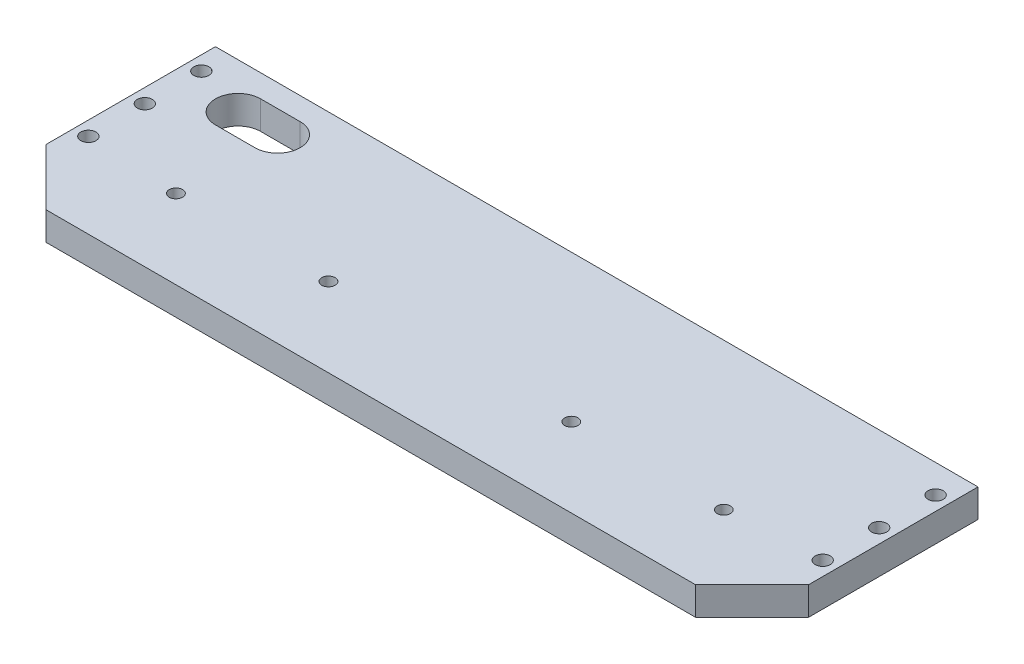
ISO-10303-21;
HEADER;
FILE_DESCRIPTION(('STEP AP214'),'2;1');
FILE_NAME('part.step','',(''),(''),'','','');
FILE_SCHEMA(('AUTOMOTIVE_DESIGN { 1 0 10303 214 1 1 1 1 }'));
ENDSEC;
DATA;
#1=APPLICATION_CONTEXT('core data for automotive mechanical design processes');
#2=APPLICATION_PROTOCOL_DEFINITION('international standard','automotive_design',2000,#1);
#3=PRODUCT_CONTEXT('',#1,'mechanical');
#4=PRODUCT('Part','Part','',(#3));
#5=PRODUCT_RELATED_PRODUCT_CATEGORY('part','',(#4));
#6=PRODUCT_DEFINITION_FORMATION('','',#4);
#7=PRODUCT_DEFINITION_CONTEXT('part definition',#1,'design');
#8=PRODUCT_DEFINITION('design','',#6,#7);
#9=PRODUCT_DEFINITION_SHAPE('','',#8);
#10=(LENGTH_UNIT() NAMED_UNIT(*) SI_UNIT(.MILLI.,.METRE.));
#11=(NAMED_UNIT(*) PLANE_ANGLE_UNIT() SI_UNIT($,.RADIAN.));
#12=(NAMED_UNIT(*) SI_UNIT($,.STERADIAN.) SOLID_ANGLE_UNIT());
#13=UNCERTAINTY_MEASURE_WITH_UNIT(LENGTH_MEASURE(1.E-05),#10,'distance_accuracy_value','');
#14=(GEOMETRIC_REPRESENTATION_CONTEXT(3) GLOBAL_UNCERTAINTY_ASSIGNED_CONTEXT((#13)) GLOBAL_UNIT_ASSIGNED_CONTEXT((#10,
#11,#12)) REPRESENTATION_CONTEXT('',''));
#15=CARTESIAN_POINT('',(0.,0.,0.));
#16=DIRECTION('',(0.,0.,1.));
#17=DIRECTION('',(1.,0.,0.));
#18=AXIS2_PLACEMENT_3D('',#15,#16,#17);
#19=CARTESIAN_POINT('',(-32.525054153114,279.4,50.8));
#20=DIRECTION('',(-1.,0.,0.));
#21=DIRECTION('',(0.,-1.,0.));
#22=AXIS2_PLACEMENT_3D('',#19,#20,#21);
#23=PLANE('',#22);
#24=DIRECTION('',(0.,0.,-1.));
#25=VECTOR('',#24,1.);
#26=CARTESIAN_POINT('',(-32.525054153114,279.4,50.8));
#27=LINE('',#26,#25);
#28=CARTESIAN_POINT('',(-32.525054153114,279.4,38.1));
#29=VERTEX_POINT('',#28);
#30=CARTESIAN_POINT('',(-32.525054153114,279.4,0.));
#31=VERTEX_POINT('',#30);
#32=EDGE_CURVE('E228',#29,#31,#27,.T.);
#33=ORIENTED_EDGE('',*,*,#32,.F.);
#34=DIRECTION('',(0.,-1.,0.));
#35=VECTOR('',#34,1.);
#36=CARTESIAN_POINT('',(-32.525054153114,279.4,38.1));
#37=LINE('',#36,#35);
#38=CARTESIAN_POINT('',(-32.5250541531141,273.05,38.1));
#39=VERTEX_POINT('',#38);
#40=EDGE_CURVE('E11',#29,#39,#37,.T.);
#41=ORIENTED_EDGE('',*,*,#40,.T.);
#42=DIRECTION('',(0.,0.,-1.));
#43=VECTOR('',#42,1.);
#44=CARTESIAN_POINT('',(-32.5250541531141,273.05,50.8));
#45=LINE('',#44,#43);
#46=CARTESIAN_POINT('',(-32.5250541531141,273.05,0.));
#47=VERTEX_POINT('',#46);
#48=EDGE_CURVE('E212',#39,#47,#45,.T.);
#49=ORIENTED_EDGE('',*,*,#48,.T.);
#50=DIRECTION('',(0.,1.,0.));
#51=VECTOR('',#50,1.);
#52=CARTESIAN_POINT('',(-32.525054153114,279.4,0.));
#53=LINE('',#52,#51);
#54=EDGE_CURVE('E202',#47,#31,#53,.T.);
#55=ORIENTED_EDGE('',*,*,#54,.T.);
#56=EDGE_LOOP('',(#33,#41,#49,#55));
#57=FACE_BOUND('',#56,.T.);
#58=ADVANCED_FACE('F32',(#57),#23,.F.);
#59=CARTESIAN_POINT('',(-32.525054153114,279.4,50.8));
#60=DIRECTION('',(0.,-1.,0.));
#61=DIRECTION('',(0.,0.,-1.));
#62=AXIS2_PLACEMENT_3D('',#59,#60,#61);
#63=PLANE('',#62);
#64=DIRECTION('',(1.,0.,0.));
#65=VECTOR('',#64,1.);
#66=CARTESIAN_POINT('',(-179.845054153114,279.4,5.08));
#67=LINE('',#66,#65);
#68=CARTESIAN_POINT('',(-188.735054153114,279.4,5.08));
#69=VERTEX_POINT('',#68);
#70=CARTESIAN_POINT('',(-179.845054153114,279.4,5.08));
#71=VERTEX_POINT('',#70);
#72=EDGE_CURVE('E116',#69,#71,#67,.T.);
#73=ORIENTED_EDGE('',*,*,#72,.T.);
#74=CARTESIAN_POINT('',(-179.845054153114,279.4,10.16));
#75=DIRECTION('',(0.,-1.,0.));
#76=DIRECTION('',(0.,0.,-1.));
#77=AXIS2_PLACEMENT_3D('',#74,#75,#76);
#78=CIRCLE('',#77,5.08);
#79=CARTESIAN_POINT('',(-179.845054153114,279.4,15.24));
#80=VERTEX_POINT('',#79);
#81=EDGE_CURVE('E110',#71,#80,#78,.T.);
#82=ORIENTED_EDGE('',*,*,#81,.T.);
#83=DIRECTION('',(-1.,0.,0.));
#84=VECTOR('',#83,1.);
#85=CARTESIAN_POINT('',(-179.845054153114,279.4,15.24));
#86=LINE('',#85,#84);
#87=CARTESIAN_POINT('',(-188.735054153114,279.4,15.24));
#88=VERTEX_POINT('',#87);
#89=EDGE_CURVE('E119',#80,#88,#86,.T.);
#90=ORIENTED_EDGE('',*,*,#89,.T.);
#91=CARTESIAN_POINT('',(-188.735054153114,279.4,10.16));
#92=DIRECTION('',(0.,-1.,0.));
#93=DIRECTION('',(0.,0.,-1.));
#94=AXIS2_PLACEMENT_3D('',#91,#92,#93);
#95=CIRCLE('',#94,5.08);
#96=EDGE_CURVE('E47',#88,#69,#95,.T.);
#97=ORIENTED_EDGE('',*,*,#96,.T.);
#98=EDGE_LOOP('',(#73,#82,#90,#97));
#99=FACE_BOUND('',#98,.T.);
#100=CARTESIAN_POINT('',(-35.7000541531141,279.4,6.34999999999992));
#101=DIRECTION('',(0.,1.,0.));
#102=DIRECTION('',(0.,0.,-1.));
#103=AXIS2_PLACEMENT_3D('',#100,#101,#102);
#104=CIRCLE('',#103,1.7);
#105=CARTESIAN_POINT('',(-35.7000541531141,279.4,8.04999999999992));
#106=VERTEX_POINT('',#105);
#107=EDGE_CURVE('E141',#106,#106,#104,.T.);
#108=ORIENTED_EDGE('',*,*,#107,.F.);
#109=EDGE_LOOP('',(#108));
#110=FACE_BOUND('',#109,.T.);
#111=CARTESIAN_POINT('',(-35.7000541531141,279.4,19.0499999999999));
#112=DIRECTION('',(0.,1.,0.));
#113=DIRECTION('',(0.,0.,-1.));
#114=AXIS2_PLACEMENT_3D('',#111,#112,#113);
#115=CIRCLE('',#114,1.7);
#116=CARTESIAN_POINT('',(-35.7000541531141,279.4,20.7499999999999));
#117=VERTEX_POINT('',#116);
#118=EDGE_CURVE('E148',#117,#117,#115,.T.);
#119=ORIENTED_EDGE('',*,*,#118,.F.);
#120=EDGE_LOOP('',(#119));
#121=FACE_BOUND('',#120,.T.);
#122=CARTESIAN_POINT('',(-35.700054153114,279.4,31.7499999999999));
#123=DIRECTION('',(0.,1.,0.));
#124=DIRECTION('',(0.,0.,1.));
#125=AXIS2_PLACEMENT_3D('',#122,#123,#124);
#126=CIRCLE('',#125,1.7);
#127=CARTESIAN_POINT('',(-35.700054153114,279.4,33.4499999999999));
#128=VERTEX_POINT('',#127);
#129=EDGE_CURVE('E154',#128,#128,#126,.T.);
#130=ORIENTED_EDGE('',*,*,#129,.F.);
#131=EDGE_LOOP('',(#130));
#132=FACE_BOUND('',#131,.T.);
#133=CARTESIAN_POINT('',(-200.800054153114,279.4,31.75));
#134=DIRECTION('',(0.,1.,0.));
#135=DIRECTION('',(0.,0.,-1.));
#136=AXIS2_PLACEMENT_3D('',#133,#134,#135);
#137=CIRCLE('',#136,1.70000000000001);
#138=CARTESIAN_POINT('',(-200.800054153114,279.4,33.45));
#139=VERTEX_POINT('',#138);
#140=EDGE_CURVE('E160',#139,#139,#137,.T.);
#141=ORIENTED_EDGE('',*,*,#140,.F.);
#142=EDGE_LOOP('',(#141));
#143=FACE_BOUND('',#142,.T.);
#144=CARTESIAN_POINT('',(-200.800054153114,279.4,19.05));
#145=DIRECTION('',(0.,1.,0.));
#146=DIRECTION('',(0.,0.,1.));
#147=AXIS2_PLACEMENT_3D('',#144,#145,#146);
#148=CIRCLE('',#147,1.70000000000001);
#149=CARTESIAN_POINT('',(-200.800054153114,279.4,20.75));
#150=VERTEX_POINT('',#149);
#151=EDGE_CURVE('E166',#150,#150,#148,.T.);
#152=ORIENTED_EDGE('',*,*,#151,.F.);
#153=EDGE_LOOP('',(#152));
#154=FACE_BOUND('',#153,.T.);
#155=CARTESIAN_POINT('',(-200.800054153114,279.4,6.34999999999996));
#156=DIRECTION('',(0.,1.,0.));
#157=DIRECTION('',(0.,0.,1.));
#158=AXIS2_PLACEMENT_3D('',#155,#156,#157);
#159=CIRCLE('',#158,1.70000000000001);
#160=CARTESIAN_POINT('',(-200.800054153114,279.4,8.04999999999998));
#161=VERTEX_POINT('',#160);
#162=EDGE_CURVE('E172',#161,#161,#159,.T.);
#163=ORIENTED_EDGE('',*,*,#162,.F.);
#164=EDGE_LOOP('',(#163));
#165=FACE_BOUND('',#164,.T.);
#166=CARTESIAN_POINT('',(-179.845054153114,279.4,33.02));
#167=DIRECTION('',(0.,1.,0.));
#168=DIRECTION('',(0.,0.,1.));
#169=AXIS2_PLACEMENT_3D('',#166,#167,#168);
#170=CIRCLE('',#169,1.5);
#171=CARTESIAN_POINT('',(-179.845054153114,279.4,34.52));
#172=VERTEX_POINT('',#171);
#173=EDGE_CURVE('E178',#172,#172,#170,.T.);
#174=ORIENTED_EDGE('',*,*,#173,.F.);
#175=EDGE_LOOP('',(#174));
#176=FACE_BOUND('',#175,.T.);
#177=CARTESIAN_POINT('',(-145.555054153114,279.4,33.02));
#178=DIRECTION('',(0.,1.,0.));
#179=DIRECTION('',(0.,0.,1.));
#180=AXIS2_PLACEMENT_3D('',#177,#178,#179);
#181=CIRCLE('',#180,1.5);
#182=CARTESIAN_POINT('',(-145.555054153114,279.4,34.52));
#183=VERTEX_POINT('',#182);
#184=EDGE_CURVE('E184',#183,#183,#181,.T.);
#185=ORIENTED_EDGE('',*,*,#184,.F.);
#186=EDGE_LOOP('',(#185));
#187=FACE_BOUND('',#186,.T.);
#188=CARTESIAN_POINT('',(-56.6550541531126,279.4,33.02));
#189=DIRECTION('',(0.,1.,0.));
#190=DIRECTION('',(0.,0.,1.));
#191=AXIS2_PLACEMENT_3D('',#188,#189,#190);
#192=CIRCLE('',#191,1.5);
#193=CARTESIAN_POINT('',(-56.6550541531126,279.4,34.52));
#194=VERTEX_POINT('',#193);
#195=EDGE_CURVE('E190',#194,#194,#192,.T.);
#196=ORIENTED_EDGE('',*,*,#195,.F.);
#197=EDGE_LOOP('',(#196));
#198=FACE_BOUND('',#197,.T.);
#199=CARTESIAN_POINT('',(-90.9450541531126,279.4,33.02));
#200=DIRECTION('',(0.,1.,0.));
#201=DIRECTION('',(0.,0.,1.));
#202=AXIS2_PLACEMENT_3D('',#199,#200,#201);
#203=CIRCLE('',#202,1.5);
#204=CARTESIAN_POINT('',(-90.9450541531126,279.4,34.52));
#205=VERTEX_POINT('',#204);
#206=EDGE_CURVE('E196',#205,#205,#203,.T.);
#207=ORIENTED_EDGE('',*,*,#206,.F.);
#208=EDGE_LOOP('',(#207));
#209=FACE_BOUND('',#208,.T.);
#210=DIRECTION('',(0.,0.,-1.));
#211=VECTOR('',#210,1.);
#212=CARTESIAN_POINT('',(-203.975054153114,279.4,50.8));
#213=LINE('',#212,#211);
#214=CARTESIAN_POINT('',(-203.975054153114,279.4,38.0999999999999));
#215=VERTEX_POINT('',#214);
#216=CARTESIAN_POINT('',(-203.975054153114,279.4,0.));
#217=VERTEX_POINT('',#216);
#218=EDGE_CURVE('E226',#215,#217,#213,.T.);
#219=ORIENTED_EDGE('',*,*,#218,.F.);
#220=DIRECTION('',(-0.707106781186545,0.,-0.70710678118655));
#221=VECTOR('',#220,1.);
#222=CARTESIAN_POINT('',(-191.275054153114,279.4,50.8));
#223=LINE('',#222,#221);
#224=CARTESIAN_POINT('',(-191.275054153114,279.4,50.8));
#225=VERTEX_POINT('',#224);
#226=EDGE_CURVE('E40',#215,#225,#223,.F.);
#227=ORIENTED_EDGE('',*,*,#226,.T.);
#228=DIRECTION('',(-1.,0.,0.));
#229=VECTOR('',#228,1.);
#230=CARTESIAN_POINT('',(-32.525054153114,279.4,50.8));
#231=LINE('',#230,#229);
#232=CARTESIAN_POINT('',(-45.225054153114,279.4,50.8));
#233=VERTEX_POINT('',#232);
#234=EDGE_CURVE('E205',#233,#225,#231,.T.);
#235=ORIENTED_EDGE('',*,*,#234,.F.);
#236=DIRECTION('',(-0.707106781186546,0.,0.707106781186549));
#237=VECTOR('',#236,1.);
#238=CARTESIAN_POINT('',(-45.2250541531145,279.4,50.8000000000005));
#239=LINE('',#238,#237);
#240=EDGE_CURVE('E242',#233,#29,#239,.F.);
#241=ORIENTED_EDGE('',*,*,#240,.T.);
#242=ORIENTED_EDGE('',*,*,#32,.T.);
#243=DIRECTION('',(-1.,0.,0.));
#244=VECTOR('',#243,1.);
#245=CARTESIAN_POINT('',(-32.525054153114,279.4,0.));
#246=LINE('',#245,#244);
#247=EDGE_CURVE('E215',#31,#217,#246,.T.);
#248=ORIENTED_EDGE('',*,*,#247,.T.);
#249=EDGE_LOOP('',(#219,#227,#235,#241,#242,#248));
#250=FACE_BOUND('',#249,.T.);
#251=ADVANCED_FACE('F123',(#99,#110,#121,#132,#143,#154,#165,#176,#187,#198,#209,#250),#63,.F.);
#252=CARTESIAN_POINT('',(-203.975054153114,279.4,50.8));
#253=DIRECTION('',(1.,0.,0.));
#254=DIRECTION('',(0.,0.,-1.));
#255=AXIS2_PLACEMENT_3D('',#252,#253,#254);
#256=PLANE('',#255);
#257=DIRECTION('',(0.,0.,-1.));
#258=VECTOR('',#257,1.);
#259=CARTESIAN_POINT('',(-203.975054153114,273.05,50.8));
#260=LINE('',#259,#258);
#261=CARTESIAN_POINT('',(-203.975054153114,273.05,38.0999999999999));
#262=VERTEX_POINT('',#261);
#263=CARTESIAN_POINT('',(-203.975054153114,273.05,0.));
#264=VERTEX_POINT('',#263);
#265=EDGE_CURVE('E224',#262,#264,#260,.T.);
#266=ORIENTED_EDGE('',*,*,#265,.F.);
#267=DIRECTION('',(0.,1.,0.));
#268=VECTOR('',#267,1.);
#269=CARTESIAN_POINT('',(-203.975054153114,279.4,38.0999999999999));
#270=LINE('',#269,#268);
#271=EDGE_CURVE('E240',#262,#215,#270,.T.);
#272=ORIENTED_EDGE('',*,*,#271,.T.);
#273=ORIENTED_EDGE('',*,*,#218,.T.);
#274=DIRECTION('',(0.,-1.,0.));
#275=VECTOR('',#274,1.);
#276=CARTESIAN_POINT('',(-203.975054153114,279.4,0.));
#277=LINE('',#276,#275);
#278=EDGE_CURVE('E218',#217,#264,#277,.T.);
#279=ORIENTED_EDGE('',*,*,#278,.T.);
#280=EDGE_LOOP('',(#266,#272,#273,#279));
#281=FACE_BOUND('',#280,.T.);
#282=ADVANCED_FACE('F259',(#281),#256,.F.);
#283=CARTESIAN_POINT('',(-32.5250541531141,273.05,50.8));
#284=DIRECTION('',(0.,1.,0.));
#285=DIRECTION('',(0.,0.,1.));
#286=AXIS2_PLACEMENT_3D('',#283,#284,#285);
#287=PLANE('',#286);
#288=DIRECTION('',(-1.,0.,0.));
#289=VECTOR('',#288,1.);
#290=CARTESIAN_POINT('',(-179.845054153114,273.05,15.24));
#291=LINE('',#290,#289);
#292=CARTESIAN_POINT('',(-179.845054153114,273.05,15.24));
#293=VERTEX_POINT('',#292);
#294=CARTESIAN_POINT('',(-188.735054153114,273.05,15.24));
#295=VERTEX_POINT('',#294);
#296=EDGE_CURVE('E135',#293,#295,#291,.T.);
#297=ORIENTED_EDGE('',*,*,#296,.F.);
#298=CARTESIAN_POINT('',(-179.845054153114,273.05,10.16));
#299=DIRECTION('',(0.,-1.,0.));
#300=DIRECTION('',(0.,0.,-1.));
#301=AXIS2_PLACEMENT_3D('',#298,#299,#300);
#302=CIRCLE('',#301,5.08);
#303=CARTESIAN_POINT('',(-179.845054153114,273.05,5.08));
#304=VERTEX_POINT('',#303);
#305=EDGE_CURVE('E55',#304,#293,#302,.T.);
#306=ORIENTED_EDGE('',*,*,#305,.F.);
#307=DIRECTION('',(1.,0.,0.));
#308=VECTOR('',#307,1.);
#309=CARTESIAN_POINT('',(-179.845054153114,273.05,5.08));
#310=LINE('',#309,#308);
#311=CARTESIAN_POINT('',(-188.735054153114,273.05,5.08));
#312=VERTEX_POINT('',#311);
#313=EDGE_CURVE('E126',#312,#304,#310,.T.);
#314=ORIENTED_EDGE('',*,*,#313,.F.);
#315=CARTESIAN_POINT('',(-188.735054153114,273.05,10.16));
#316=DIRECTION('',(0.,-1.,0.));
#317=DIRECTION('',(0.,0.,-1.));
#318=AXIS2_PLACEMENT_3D('',#315,#316,#317);
#319=CIRCLE('',#318,5.08);
#320=EDGE_CURVE('E129',#295,#312,#319,.T.);
#321=ORIENTED_EDGE('',*,*,#320,.F.);
#322=EDGE_LOOP('',(#297,#306,#314,#321));
#323=FACE_BOUND('',#322,.T.);
#324=CARTESIAN_POINT('',(-35.7000541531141,273.05,6.34999999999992));
#325=DIRECTION('',(0.,1.,0.));
#326=DIRECTION('',(0.,0.,-1.));
#327=AXIS2_PLACEMENT_3D('',#324,#325,#326);
#328=CIRCLE('',#327,1.7);
#329=CARTESIAN_POINT('',(-35.7000541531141,273.05,8.04999999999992));
#330=VERTEX_POINT('',#329);
#331=EDGE_CURVE('E145',#330,#330,#328,.T.);
#332=ORIENTED_EDGE('',*,*,#331,.T.);
#333=EDGE_LOOP('',(#332));
#334=FACE_BOUND('',#333,.T.);
#335=CARTESIAN_POINT('',(-35.7000541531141,273.05,19.0499999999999));
#336=DIRECTION('',(0.,1.,0.));
#337=DIRECTION('',(0.,0.,-1.));
#338=AXIS2_PLACEMENT_3D('',#335,#336,#337);
#339=CIRCLE('',#338,1.7);
#340=CARTESIAN_POINT('',(-35.7000541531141,273.05,20.7499999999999));
#341=VERTEX_POINT('',#340);
#342=EDGE_CURVE('E151',#341,#341,#339,.T.);
#343=ORIENTED_EDGE('',*,*,#342,.T.);
#344=EDGE_LOOP('',(#343));
#345=FACE_BOUND('',#344,.T.);
#346=CARTESIAN_POINT('',(-35.700054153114,273.05,31.7499999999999));
#347=DIRECTION('',(0.,1.,0.));
#348=DIRECTION('',(0.,0.,1.));
#349=AXIS2_PLACEMENT_3D('',#346,#347,#348);
#350=CIRCLE('',#349,1.7);
#351=CARTESIAN_POINT('',(-35.700054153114,273.05,33.4499999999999));
#352=VERTEX_POINT('',#351);
#353=EDGE_CURVE('E157',#352,#352,#350,.T.);
#354=ORIENTED_EDGE('',*,*,#353,.T.);
#355=EDGE_LOOP('',(#354));
#356=FACE_BOUND('',#355,.T.);
#357=CARTESIAN_POINT('',(-200.800054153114,273.05,31.75));
#358=DIRECTION('',(0.,1.,0.));
#359=DIRECTION('',(0.,0.,-1.));
#360=AXIS2_PLACEMENT_3D('',#357,#358,#359);
#361=CIRCLE('',#360,1.70000000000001);
#362=CARTESIAN_POINT('',(-200.800054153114,273.05,33.45));
#363=VERTEX_POINT('',#362);
#364=EDGE_CURVE('E163',#363,#363,#361,.T.);
#365=ORIENTED_EDGE('',*,*,#364,.T.);
#366=EDGE_LOOP('',(#365));
#367=FACE_BOUND('',#366,.T.);
#368=CARTESIAN_POINT('',(-200.800054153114,273.05,19.05));
#369=DIRECTION('',(0.,1.,0.));
#370=DIRECTION('',(0.,0.,1.));
#371=AXIS2_PLACEMENT_3D('',#368,#369,#370);
#372=CIRCLE('',#371,1.70000000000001);
#373=CARTESIAN_POINT('',(-200.800054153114,273.05,20.75));
#374=VERTEX_POINT('',#373);
#375=EDGE_CURVE('E169',#374,#374,#372,.T.);
#376=ORIENTED_EDGE('',*,*,#375,.T.);
#377=EDGE_LOOP('',(#376));
#378=FACE_BOUND('',#377,.T.);
#379=CARTESIAN_POINT('',(-200.800054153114,273.05,6.34999999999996));
#380=DIRECTION('',(0.,1.,0.));
#381=DIRECTION('',(0.,0.,1.));
#382=AXIS2_PLACEMENT_3D('',#379,#380,#381);
#383=CIRCLE('',#382,1.70000000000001);
#384=CARTESIAN_POINT('',(-200.800054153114,273.05,8.04999999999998));
#385=VERTEX_POINT('',#384);
#386=EDGE_CURVE('E175',#385,#385,#383,.T.);
#387=ORIENTED_EDGE('',*,*,#386,.T.);
#388=EDGE_LOOP('',(#387));
#389=FACE_BOUND('',#388,.T.);
#390=CARTESIAN_POINT('',(-179.845054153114,273.05,33.02));
#391=DIRECTION('',(0.,1.,0.));
#392=DIRECTION('',(0.,0.,1.));
#393=AXIS2_PLACEMENT_3D('',#390,#391,#392);
#394=CIRCLE('',#393,1.5);
#395=CARTESIAN_POINT('',(-179.845054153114,273.05,34.52));
#396=VERTEX_POINT('',#395);
#397=EDGE_CURVE('E181',#396,#396,#394,.T.);
#398=ORIENTED_EDGE('',*,*,#397,.T.);
#399=EDGE_LOOP('',(#398));
#400=FACE_BOUND('',#399,.T.);
#401=CARTESIAN_POINT('',(-145.555054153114,273.05,33.02));
#402=DIRECTION('',(0.,1.,0.));
#403=DIRECTION('',(0.,0.,1.));
#404=AXIS2_PLACEMENT_3D('',#401,#402,#403);
#405=CIRCLE('',#404,1.5);
#406=CARTESIAN_POINT('',(-145.555054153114,273.05,34.52));
#407=VERTEX_POINT('',#406);
#408=EDGE_CURVE('E187',#407,#407,#405,.T.);
#409=ORIENTED_EDGE('',*,*,#408,.T.);
#410=EDGE_LOOP('',(#409));
#411=FACE_BOUND('',#410,.T.);
#412=CARTESIAN_POINT('',(-56.6550541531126,273.05,33.02));
#413=DIRECTION('',(0.,1.,0.));
#414=DIRECTION('',(0.,0.,1.));
#415=AXIS2_PLACEMENT_3D('',#412,#413,#414);
#416=CIRCLE('',#415,1.5);
#417=CARTESIAN_POINT('',(-56.6550541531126,273.05,34.52));
#418=VERTEX_POINT('',#417);
#419=EDGE_CURVE('E193',#418,#418,#416,.T.);
#420=ORIENTED_EDGE('',*,*,#419,.T.);
#421=EDGE_LOOP('',(#420));
#422=FACE_BOUND('',#421,.T.);
#423=CARTESIAN_POINT('',(-90.9450541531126,273.05,33.02));
#424=DIRECTION('',(0.,1.,0.));
#425=DIRECTION('',(0.,0.,1.));
#426=AXIS2_PLACEMENT_3D('',#423,#424,#425);
#427=CIRCLE('',#426,1.5);
#428=CARTESIAN_POINT('',(-90.9450541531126,273.05,34.52));
#429=VERTEX_POINT('',#428);
#430=EDGE_CURVE('E199',#429,#429,#427,.T.);
#431=ORIENTED_EDGE('',*,*,#430,.T.);
#432=EDGE_LOOP('',(#431));
#433=FACE_BOUND('',#432,.T.);
#434=DIRECTION('',(1.,0.,0.));
#435=VECTOR('',#434,1.);
#436=CARTESIAN_POINT('',(-32.5250541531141,273.05,50.8));
#437=LINE('',#436,#435);
#438=CARTESIAN_POINT('',(-191.275054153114,273.05,50.8));
#439=VERTEX_POINT('',#438);
#440=CARTESIAN_POINT('',(-45.2250541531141,273.05,50.8));
#441=VERTEX_POINT('',#440);
#442=EDGE_CURVE('E208',#439,#441,#437,.T.);
#443=ORIENTED_EDGE('',*,*,#442,.F.);
#444=DIRECTION('',(0.707106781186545,0.,0.70710678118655));
#445=VECTOR('',#444,1.);
#446=CARTESIAN_POINT('',(-191.275054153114,273.05,50.8));
#447=LINE('',#446,#445);
#448=EDGE_CURVE('E238',#439,#262,#447,.F.);
#449=ORIENTED_EDGE('',*,*,#448,.T.);
#450=ORIENTED_EDGE('',*,*,#265,.T.);
#451=DIRECTION('',(1.,0.,0.));
#452=VECTOR('',#451,1.);
#453=CARTESIAN_POINT('',(-32.5250541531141,273.05,0.));
#454=LINE('',#453,#452);
#455=EDGE_CURVE('E209',#264,#47,#454,.T.);
#456=ORIENTED_EDGE('',*,*,#455,.T.);
#457=ORIENTED_EDGE('',*,*,#48,.F.);
#458=DIRECTION('',(0.707106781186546,0.,-0.707106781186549));
#459=VECTOR('',#458,1.);
#460=CARTESIAN_POINT('',(-45.2250541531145,273.05,50.8000000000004));
#461=LINE('',#460,#459);
#462=EDGE_CURVE('E236',#39,#441,#461,.F.);
#463=ORIENTED_EDGE('',*,*,#462,.T.);
#464=EDGE_LOOP('',(#443,#449,#450,#456,#457,#463));
#465=FACE_BOUND('',#464,.T.);
#466=ADVANCED_FACE('F257',(#323,#334,#345,#356,#367,#378,#389,#400,#411,#422,#433,#465),#287,.F.);
#467=CARTESIAN_POINT('',(0.,0.,50.8));
#468=DIRECTION('',(0.,0.,-1.));
#469=DIRECTION('',(-1.,0.,0.));
#470=AXIS2_PLACEMENT_3D('',#467,#468,#469);
#471=PLANE('',#470);
#472=ORIENTED_EDGE('',*,*,#234,.T.);
#473=DIRECTION('',(0.,-1.,0.));
#474=VECTOR('',#473,1.);
#475=CARTESIAN_POINT('',(-191.275054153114,0.,50.8));
#476=LINE('',#475,#474);
#477=EDGE_CURVE('E233',#225,#439,#476,.T.);
#478=ORIENTED_EDGE('',*,*,#477,.T.);
#479=ORIENTED_EDGE('',*,*,#442,.T.);
#480=DIRECTION('',(0.,1.,0.));
#481=VECTOR('',#480,1.);
#482=CARTESIAN_POINT('',(-45.225054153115,1.48257568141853E-13,50.8));
#483=LINE('',#482,#481);
#484=EDGE_CURVE('E230',#441,#233,#483,.T.);
#485=ORIENTED_EDGE('',*,*,#484,.T.);
#486=EDGE_LOOP('',(#472,#478,#479,#485));
#487=FACE_BOUND('',#486,.T.);
#488=ADVANCED_FACE('F251',(#487),#471,.F.);
#489=CARTESIAN_POINT('',(0.,0.,0.));
#490=DIRECTION('',(0.,0.,-1.));
#491=DIRECTION('',(-1.,0.,0.));
#492=AXIS2_PLACEMENT_3D('',#489,#490,#491);
#493=PLANE('',#492);
#494=ORIENTED_EDGE('',*,*,#54,.F.);
#495=ORIENTED_EDGE('',*,*,#455,.F.);
#496=ORIENTED_EDGE('',*,*,#278,.F.);
#497=ORIENTED_EDGE('',*,*,#247,.F.);
#498=EDGE_LOOP('',(#494,#495,#496,#497));
#499=FACE_BOUND('',#498,.T.);
#500=ADVANCED_FACE('F265',(#499),#493,.T.);
#501=CARTESIAN_POINT('',(-191.275054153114,0.,50.8));
#502=DIRECTION('',(0.70710678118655,0.,-0.707106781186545));
#503=DIRECTION('',(0.,-1.,0.));
#504=AXIS2_PLACEMENT_3D('',#501,#502,#503);
#505=PLANE('',#504);
#506=ORIENTED_EDGE('',*,*,#226,.F.);
#507=ORIENTED_EDGE('',*,*,#271,.F.);
#508=ORIENTED_EDGE('',*,*,#448,.F.);
#509=ORIENTED_EDGE('',*,*,#477,.F.);
#510=EDGE_LOOP('',(#506,#507,#508,#509));
#511=FACE_BOUND('',#510,.T.);
#512=ADVANCED_FACE('F254',(#511),#505,.F.);
#513=CARTESIAN_POINT('',(-45.225054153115,1.48257568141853E-13,50.8));
#514=DIRECTION('',(-0.707106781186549,0.,-0.707106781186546));
#515=DIRECTION('',(0.,1.,0.));
#516=AXIS2_PLACEMENT_3D('',#513,#514,#515);
#517=PLANE('',#516);
#518=ORIENTED_EDGE('',*,*,#462,.F.);
#519=ORIENTED_EDGE('',*,*,#40,.F.);
#520=ORIENTED_EDGE('',*,*,#240,.F.);
#521=ORIENTED_EDGE('',*,*,#484,.F.);
#522=EDGE_LOOP('',(#518,#519,#520,#521));
#523=FACE_BOUND('',#522,.T.);
#524=ADVANCED_FACE('F34',(#523),#517,.F.);
#525=CARTESIAN_POINT('',(-90.9450541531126,273.05,33.02));
#526=DIRECTION('',(0.,1.,0.));
#527=DIRECTION('',(0.,0.,1.));
#528=AXIS2_PLACEMENT_3D('',#525,#526,#527);
#529=CYLINDRICAL_SURFACE('',#528,1.5);
#530=CARTESIAN_POINT('',(-90.9450541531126,273.05,34.52));
#531=CARTESIAN_POINT('',(-90.9450541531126,273.116145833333,34.52));
#532=CARTESIAN_POINT('',(-90.9450541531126,273.182291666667,34.52));
#533=CARTESIAN_POINT('',(-90.9450541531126,273.314583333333,34.52));
#534=CARTESIAN_POINT('',(-90.9450541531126,273.380729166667,34.52));
#535=CARTESIAN_POINT('',(-90.9450541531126,273.513020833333,34.52));
#536=CARTESIAN_POINT('',(-90.9450541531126,273.579166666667,34.52));
#537=CARTESIAN_POINT('',(-90.9450541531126,273.711458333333,34.52));
#538=CARTESIAN_POINT('',(-90.9450541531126,273.777604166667,34.52));
#539=CARTESIAN_POINT('',(-90.9450541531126,273.909895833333,34.52));
#540=CARTESIAN_POINT('',(-90.9450541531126,273.976041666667,34.52));
#541=CARTESIAN_POINT('',(-90.9450541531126,274.108333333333,34.52));
#542=CARTESIAN_POINT('',(-90.9450541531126,274.174479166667,34.52));
#543=CARTESIAN_POINT('',(-90.9450541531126,274.306770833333,34.52));
#544=CARTESIAN_POINT('',(-90.9450541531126,274.372916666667,34.52));
#545=CARTESIAN_POINT('',(-90.9450541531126,274.505208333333,34.52));
#546=CARTESIAN_POINT('',(-90.9450541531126,274.571354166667,34.52));
#547=CARTESIAN_POINT('',(-90.9450541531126,274.703645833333,34.52));
#548=CARTESIAN_POINT('',(-90.9450541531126,274.769791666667,34.52));
#549=CARTESIAN_POINT('',(-90.9450541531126,274.902083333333,34.52));
#550=CARTESIAN_POINT('',(-90.9450541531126,274.968229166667,34.52));
#551=CARTESIAN_POINT('',(-90.9450541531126,275.100520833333,34.52));
#552=CARTESIAN_POINT('',(-90.9450541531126,275.166666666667,34.52));
#553=CARTESIAN_POINT('',(-90.9450541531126,275.298958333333,34.52));
#554=CARTESIAN_POINT('',(-90.9450541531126,275.365104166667,34.52));
#555=CARTESIAN_POINT('',(-90.9450541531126,275.497395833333,34.52));
#556=CARTESIAN_POINT('',(-90.9450541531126,275.563541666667,34.52));
#557=CARTESIAN_POINT('',(-90.9450541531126,275.695833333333,34.52));
#558=CARTESIAN_POINT('',(-90.9450541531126,275.761979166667,34.52));
#559=CARTESIAN_POINT('',(-90.9450541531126,275.894270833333,34.52));
#560=CARTESIAN_POINT('',(-90.9450541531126,275.960416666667,34.52));
#561=CARTESIAN_POINT('',(-90.9450541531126,276.092708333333,34.52));
#562=CARTESIAN_POINT('',(-90.9450541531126,276.158854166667,34.52));
#563=CARTESIAN_POINT('',(-90.9450541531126,276.291145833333,34.52));
#564=CARTESIAN_POINT('',(-90.9450541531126,276.357291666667,34.52));
#565=CARTESIAN_POINT('',(-90.9450541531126,276.489583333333,34.52));
#566=CARTESIAN_POINT('',(-90.9450541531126,276.555729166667,34.52));
#567=CARTESIAN_POINT('',(-90.9450541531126,276.688020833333,34.52));
#568=CARTESIAN_POINT('',(-90.9450541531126,276.754166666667,34.52));
#569=CARTESIAN_POINT('',(-90.9450541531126,276.886458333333,34.52));
#570=CARTESIAN_POINT('',(-90.9450541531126,276.952604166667,34.52));
#571=CARTESIAN_POINT('',(-90.9450541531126,277.084895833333,34.52));
#572=CARTESIAN_POINT('',(-90.9450541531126,277.151041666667,34.52));
#573=CARTESIAN_POINT('',(-90.9450541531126,277.283333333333,34.52));
#574=CARTESIAN_POINT('',(-90.9450541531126,277.349479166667,34.52));
#575=CARTESIAN_POINT('',(-90.9450541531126,277.481770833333,34.52));
#576=CARTESIAN_POINT('',(-90.9450541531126,277.547916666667,34.52));
#577=CARTESIAN_POINT('',(-90.9450541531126,277.680208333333,34.52));
#578=CARTESIAN_POINT('',(-90.9450541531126,277.746354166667,34.52));
#579=CARTESIAN_POINT('',(-90.9450541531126,277.878645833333,34.52));
#580=CARTESIAN_POINT('',(-90.9450541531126,277.944791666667,34.52));
#581=CARTESIAN_POINT('',(-90.9450541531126,278.077083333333,34.52));
#582=CARTESIAN_POINT('',(-90.9450541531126,278.143229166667,34.52));
#583=CARTESIAN_POINT('',(-90.9450541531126,278.275520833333,34.52));
#584=CARTESIAN_POINT('',(-90.9450541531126,278.341666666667,34.52));
#585=CARTESIAN_POINT('',(-90.9450541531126,278.473958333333,34.52));
#586=CARTESIAN_POINT('',(-90.9450541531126,278.540104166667,34.52));
#587=CARTESIAN_POINT('',(-90.9450541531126,278.672395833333,34.52));
#588=CARTESIAN_POINT('',(-90.9450541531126,278.738541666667,34.52));
#589=CARTESIAN_POINT('',(-90.9450541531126,278.870833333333,34.52));
#590=CARTESIAN_POINT('',(-90.9450541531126,278.936979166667,34.52));
#591=CARTESIAN_POINT('',(-90.9450541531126,279.069270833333,34.52));
#592=CARTESIAN_POINT('',(-90.9450541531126,279.135416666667,34.52));
#593=CARTESIAN_POINT('',(-90.9450541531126,279.267708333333,34.52));
#594=CARTESIAN_POINT('',(-90.9450541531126,279.333854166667,34.52));
#595=CARTESIAN_POINT('',(-90.9450541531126,279.4,34.52));
#596=B_SPLINE_CURVE_WITH_KNOTS('',3,(#530,#531,#532,#533,#534,#535,#536,#537,#538,#539,#540,
#541,#542,#543,#544,#545,#546,#547,#548,#549,#550,#551,#552,#553,#554,#555,#556,#557,#558,#559,
#560,#561,#562,#563,#564,#565,#566,#567,#568,#569,#570,#571,#572,#573,#574,#575,#576,#577,#578,
#579,#580,#581,#582,#583,#584,#585,#586,#587,#588,#589,#590,#591,#592,#593,#594,#595),
.UNSPECIFIED.,.F.,.F.,(4,2,2,2,2,2,2,2,2,2,2,2,2,2,2,2,2,2,2,2,2,2,2,2,2,2,2,2,2,2,2,2,4),(0.,
0.198437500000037,0.396875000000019,0.595312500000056,0.793750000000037,0.992187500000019,
1.19062500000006,1.38906250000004,1.58750000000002,1.78593750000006,1.98437500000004,
2.18281250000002,2.38125000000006,2.57968750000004,2.77812500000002,2.97656250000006,
3.17500000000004,3.37343750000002,3.57187500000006,3.77031250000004,3.96875000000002,
4.16718750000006,4.36562500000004,4.56406250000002,4.76250000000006,4.96093750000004,
5.15937500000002,5.35781250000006,5.55625000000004,5.75468750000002,5.95312500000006,
6.15156250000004,6.35000000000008),.UNSPECIFIED.);
#597=EDGE_CURVE('BSEAM285',#429,#205,#596,.T.);
#598=ORIENTED_EDGE('',*,*,#430,.F.);
#599=ORIENTED_EDGE('',*,*,#206,.T.);
#600=ORIENTED_EDGE('',*,*,#597,.T.);
#601=ORIENTED_EDGE('',*,*,#597,.F.);
#602=EDGE_LOOP('',(#598,#600,#599,#601));
#603=FACE_BOUND('',#602,.T.);
#604=ADVANCED_FACE('F285',(#603),#529,.F.);
#605=CARTESIAN_POINT('',(-56.6550541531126,273.05,33.02));
#606=DIRECTION('',(0.,1.,0.));
#607=DIRECTION('',(0.,0.,1.));
#608=AXIS2_PLACEMENT_3D('',#605,#606,#607);
#609=CYLINDRICAL_SURFACE('',#608,1.5);
#610=CARTESIAN_POINT('',(-56.6550541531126,273.05,34.52));
#611=CARTESIAN_POINT('',(-56.6550541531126,273.116145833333,34.52));
#612=CARTESIAN_POINT('',(-56.6550541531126,273.182291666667,34.52));
#613=CARTESIAN_POINT('',(-56.6550541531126,273.314583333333,34.52));
#614=CARTESIAN_POINT('',(-56.6550541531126,273.380729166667,34.52));
#615=CARTESIAN_POINT('',(-56.6550541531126,273.513020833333,34.52));
#616=CARTESIAN_POINT('',(-56.6550541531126,273.579166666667,34.52));
#617=CARTESIAN_POINT('',(-56.6550541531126,273.711458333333,34.52));
#618=CARTESIAN_POINT('',(-56.6550541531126,273.777604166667,34.52));
#619=CARTESIAN_POINT('',(-56.6550541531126,273.909895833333,34.52));
#620=CARTESIAN_POINT('',(-56.6550541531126,273.976041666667,34.52));
#621=CARTESIAN_POINT('',(-56.6550541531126,274.108333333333,34.52));
#622=CARTESIAN_POINT('',(-56.6550541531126,274.174479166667,34.52));
#623=CARTESIAN_POINT('',(-56.6550541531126,274.306770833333,34.52));
#624=CARTESIAN_POINT('',(-56.6550541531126,274.372916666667,34.52));
#625=CARTESIAN_POINT('',(-56.6550541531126,274.505208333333,34.52));
#626=CARTESIAN_POINT('',(-56.6550541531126,274.571354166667,34.52));
#627=CARTESIAN_POINT('',(-56.6550541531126,274.703645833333,34.52));
#628=CARTESIAN_POINT('',(-56.6550541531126,274.769791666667,34.52));
#629=CARTESIAN_POINT('',(-56.6550541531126,274.902083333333,34.52));
#630=CARTESIAN_POINT('',(-56.6550541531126,274.968229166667,34.52));
#631=CARTESIAN_POINT('',(-56.6550541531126,275.100520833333,34.52));
#632=CARTESIAN_POINT('',(-56.6550541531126,275.166666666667,34.52));
#633=CARTESIAN_POINT('',(-56.6550541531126,275.298958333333,34.52));
#634=CARTESIAN_POINT('',(-56.6550541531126,275.365104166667,34.52));
#635=CARTESIAN_POINT('',(-56.6550541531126,275.497395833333,34.52));
#636=CARTESIAN_POINT('',(-56.6550541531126,275.563541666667,34.52));
#637=CARTESIAN_POINT('',(-56.6550541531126,275.695833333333,34.52));
#638=CARTESIAN_POINT('',(-56.6550541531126,275.761979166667,34.52));
#639=CARTESIAN_POINT('',(-56.6550541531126,275.894270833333,34.52));
#640=CARTESIAN_POINT('',(-56.6550541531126,275.960416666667,34.52));
#641=CARTESIAN_POINT('',(-56.6550541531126,276.092708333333,34.52));
#642=CARTESIAN_POINT('',(-56.6550541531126,276.158854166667,34.52));
#643=CARTESIAN_POINT('',(-56.6550541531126,276.291145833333,34.52));
#644=CARTESIAN_POINT('',(-56.6550541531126,276.357291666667,34.52));
#645=CARTESIAN_POINT('',(-56.6550541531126,276.489583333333,34.52));
#646=CARTESIAN_POINT('',(-56.6550541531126,276.555729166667,34.52));
#647=CARTESIAN_POINT('',(-56.6550541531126,276.688020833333,34.52));
#648=CARTESIAN_POINT('',(-56.6550541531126,276.754166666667,34.52));
#649=CARTESIAN_POINT('',(-56.6550541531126,276.886458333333,34.52));
#650=CARTESIAN_POINT('',(-56.6550541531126,276.952604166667,34.52));
#651=CARTESIAN_POINT('',(-56.6550541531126,277.084895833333,34.52));
#652=CARTESIAN_POINT('',(-56.6550541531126,277.151041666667,34.52));
#653=CARTESIAN_POINT('',(-56.6550541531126,277.283333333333,34.52));
#654=CARTESIAN_POINT('',(-56.6550541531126,277.349479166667,34.52));
#655=CARTESIAN_POINT('',(-56.6550541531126,277.481770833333,34.52));
#656=CARTESIAN_POINT('',(-56.6550541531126,277.547916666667,34.52));
#657=CARTESIAN_POINT('',(-56.6550541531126,277.680208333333,34.52));
#658=CARTESIAN_POINT('',(-56.6550541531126,277.746354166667,34.52));
#659=CARTESIAN_POINT('',(-56.6550541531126,277.878645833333,34.52));
#660=CARTESIAN_POINT('',(-56.6550541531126,277.944791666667,34.52));
#661=CARTESIAN_POINT('',(-56.6550541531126,278.077083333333,34.52));
#662=CARTESIAN_POINT('',(-56.6550541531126,278.143229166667,34.52));
#663=CARTESIAN_POINT('',(-56.6550541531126,278.275520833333,34.52));
#664=CARTESIAN_POINT('',(-56.6550541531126,278.341666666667,34.52));
#665=CARTESIAN_POINT('',(-56.6550541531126,278.473958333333,34.52));
#666=CARTESIAN_POINT('',(-56.6550541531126,278.540104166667,34.52));
#667=CARTESIAN_POINT('',(-56.6550541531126,278.672395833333,34.52));
#668=CARTESIAN_POINT('',(-56.6550541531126,278.738541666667,34.52));
#669=CARTESIAN_POINT('',(-56.6550541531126,278.870833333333,34.52));
#670=CARTESIAN_POINT('',(-56.6550541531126,278.936979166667,34.52));
#671=CARTESIAN_POINT('',(-56.6550541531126,279.069270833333,34.52));
#672=CARTESIAN_POINT('',(-56.6550541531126,279.135416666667,34.52));
#673=CARTESIAN_POINT('',(-56.6550541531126,279.267708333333,34.52));
#674=CARTESIAN_POINT('',(-56.6550541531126,279.333854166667,34.52));
#675=CARTESIAN_POINT('',(-56.6550541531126,279.4,34.52));
#676=B_SPLINE_CURVE_WITH_KNOTS('',3,(#610,#611,#612,#613,#614,#615,#616,#617,#618,#619,#620,
#621,#622,#623,#624,#625,#626,#627,#628,#629,#630,#631,#632,#633,#634,#635,#636,#637,#638,#639,
#640,#641,#642,#643,#644,#645,#646,#647,#648,#649,#650,#651,#652,#653,#654,#655,#656,#657,#658,
#659,#660,#661,#662,#663,#664,#665,#666,#667,#668,#669,#670,#671,#672,#673,#674,#675),
.UNSPECIFIED.,.F.,.F.,(4,2,2,2,2,2,2,2,2,2,2,2,2,2,2,2,2,2,2,2,2,2,2,2,2,2,2,2,2,2,2,2,4),(0.,
0.198437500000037,0.396875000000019,0.595312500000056,0.793750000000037,0.992187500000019,
1.19062500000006,1.38906250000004,1.58750000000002,1.78593750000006,1.98437500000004,
2.18281250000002,2.38125000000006,2.57968750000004,2.77812500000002,2.97656250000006,
3.17500000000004,3.37343750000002,3.57187500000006,3.77031250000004,3.96875000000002,
4.16718750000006,4.36562500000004,4.56406250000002,4.76250000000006,4.96093750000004,
5.15937500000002,5.35781250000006,5.55625000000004,5.75468750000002,5.95312500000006,
6.15156250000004,6.35000000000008),.UNSPECIFIED.);
#677=EDGE_CURVE('BSEAM331',#418,#194,#676,.T.);
#678=ORIENTED_EDGE('',*,*,#419,.F.);
#679=ORIENTED_EDGE('',*,*,#195,.T.);
#680=ORIENTED_EDGE('',*,*,#677,.T.);
#681=ORIENTED_EDGE('',*,*,#677,.F.);
#682=EDGE_LOOP('',(#678,#680,#679,#681));
#683=FACE_BOUND('',#682,.T.);
#684=ADVANCED_FACE('F331',(#683),#609,.F.);
#685=CARTESIAN_POINT('',(-145.555054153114,273.05,33.02));
#686=DIRECTION('',(0.,1.,0.));
#687=DIRECTION('',(0.,0.,1.));
#688=AXIS2_PLACEMENT_3D('',#685,#686,#687);
#689=CYLINDRICAL_SURFACE('',#688,1.5);
#690=CARTESIAN_POINT('',(-145.555054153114,273.05,34.52));
#691=CARTESIAN_POINT('',(-145.555054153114,273.116145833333,34.52));
#692=CARTESIAN_POINT('',(-145.555054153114,273.182291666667,34.52));
#693=CARTESIAN_POINT('',(-145.555054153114,273.314583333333,34.52));
#694=CARTESIAN_POINT('',(-145.555054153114,273.380729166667,34.52));
#695=CARTESIAN_POINT('',(-145.555054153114,273.513020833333,34.52));
#696=CARTESIAN_POINT('',(-145.555054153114,273.579166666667,34.52));
#697=CARTESIAN_POINT('',(-145.555054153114,273.711458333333,34.52));
#698=CARTESIAN_POINT('',(-145.555054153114,273.777604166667,34.52));
#699=CARTESIAN_POINT('',(-145.555054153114,273.909895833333,34.52));
#700=CARTESIAN_POINT('',(-145.555054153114,273.976041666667,34.52));
#701=CARTESIAN_POINT('',(-145.555054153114,274.108333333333,34.52));
#702=CARTESIAN_POINT('',(-145.555054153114,274.174479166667,34.52));
#703=CARTESIAN_POINT('',(-145.555054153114,274.306770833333,34.52));
#704=CARTESIAN_POINT('',(-145.555054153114,274.372916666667,34.52));
#705=CARTESIAN_POINT('',(-145.555054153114,274.505208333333,34.52));
#706=CARTESIAN_POINT('',(-145.555054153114,274.571354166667,34.52));
#707=CARTESIAN_POINT('',(-145.555054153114,274.703645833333,34.52));
#708=CARTESIAN_POINT('',(-145.555054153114,274.769791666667,34.52));
#709=CARTESIAN_POINT('',(-145.555054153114,274.902083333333,34.52));
#710=CARTESIAN_POINT('',(-145.555054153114,274.968229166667,34.52));
#711=CARTESIAN_POINT('',(-145.555054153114,275.100520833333,34.52));
#712=CARTESIAN_POINT('',(-145.555054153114,275.166666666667,34.52));
#713=CARTESIAN_POINT('',(-145.555054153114,275.298958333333,34.52));
#714=CARTESIAN_POINT('',(-145.555054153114,275.365104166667,34.52));
#715=CARTESIAN_POINT('',(-145.555054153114,275.497395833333,34.52));
#716=CARTESIAN_POINT('',(-145.555054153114,275.563541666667,34.52));
#717=CARTESIAN_POINT('',(-145.555054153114,275.695833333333,34.52));
#718=CARTESIAN_POINT('',(-145.555054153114,275.761979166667,34.52));
#719=CARTESIAN_POINT('',(-145.555054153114,275.894270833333,34.52));
#720=CARTESIAN_POINT('',(-145.555054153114,275.960416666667,34.52));
#721=CARTESIAN_POINT('',(-145.555054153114,276.092708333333,34.52));
#722=CARTESIAN_POINT('',(-145.555054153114,276.158854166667,34.52));
#723=CARTESIAN_POINT('',(-145.555054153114,276.291145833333,34.52));
#724=CARTESIAN_POINT('',(-145.555054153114,276.357291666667,34.52));
#725=CARTESIAN_POINT('',(-145.555054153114,276.489583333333,34.52));
#726=CARTESIAN_POINT('',(-145.555054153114,276.555729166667,34.52));
#727=CARTESIAN_POINT('',(-145.555054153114,276.688020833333,34.52));
#728=CARTESIAN_POINT('',(-145.555054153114,276.754166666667,34.52));
#729=CARTESIAN_POINT('',(-145.555054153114,276.886458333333,34.52));
#730=CARTESIAN_POINT('',(-145.555054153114,276.952604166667,34.52));
#731=CARTESIAN_POINT('',(-145.555054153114,277.084895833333,34.52));
#732=CARTESIAN_POINT('',(-145.555054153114,277.151041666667,34.52));
#733=CARTESIAN_POINT('',(-145.555054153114,277.283333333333,34.52));
#734=CARTESIAN_POINT('',(-145.555054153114,277.349479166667,34.52));
#735=CARTESIAN_POINT('',(-145.555054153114,277.481770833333,34.52));
#736=CARTESIAN_POINT('',(-145.555054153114,277.547916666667,34.52));
#737=CARTESIAN_POINT('',(-145.555054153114,277.680208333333,34.52));
#738=CARTESIAN_POINT('',(-145.555054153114,277.746354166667,34.52));
#739=CARTESIAN_POINT('',(-145.555054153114,277.878645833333,34.52));
#740=CARTESIAN_POINT('',(-145.555054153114,277.944791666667,34.52));
#741=CARTESIAN_POINT('',(-145.555054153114,278.077083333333,34.52));
#742=CARTESIAN_POINT('',(-145.555054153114,278.143229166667,34.52));
#743=CARTESIAN_POINT('',(-145.555054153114,278.275520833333,34.52));
#744=CARTESIAN_POINT('',(-145.555054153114,278.341666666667,34.52));
#745=CARTESIAN_POINT('',(-145.555054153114,278.473958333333,34.52));
#746=CARTESIAN_POINT('',(-145.555054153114,278.540104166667,34.52));
#747=CARTESIAN_POINT('',(-145.555054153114,278.672395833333,34.52));
#748=CARTESIAN_POINT('',(-145.555054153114,278.738541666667,34.52));
#749=CARTESIAN_POINT('',(-145.555054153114,278.870833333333,34.52));
#750=CARTESIAN_POINT('',(-145.555054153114,278.936979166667,34.52));
#751=CARTESIAN_POINT('',(-145.555054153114,279.069270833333,34.52));
#752=CARTESIAN_POINT('',(-145.555054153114,279.135416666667,34.52));
#753=CARTESIAN_POINT('',(-145.555054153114,279.267708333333,34.52));
#754=CARTESIAN_POINT('',(-145.555054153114,279.333854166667,34.52));
#755=CARTESIAN_POINT('',(-145.555054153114,279.4,34.52));
#756=B_SPLINE_CURVE_WITH_KNOTS('',3,(#690,#691,#692,#693,#694,#695,#696,#697,#698,#699,#700,
#701,#702,#703,#704,#705,#706,#707,#708,#709,#710,#711,#712,#713,#714,#715,#716,#717,#718,#719,
#720,#721,#722,#723,#724,#725,#726,#727,#728,#729,#730,#731,#732,#733,#734,#735,#736,#737,#738,
#739,#740,#741,#742,#743,#744,#745,#746,#747,#748,#749,#750,#751,#752,#753,#754,#755),
.UNSPECIFIED.,.F.,.F.,(4,2,2,2,2,2,2,2,2,2,2,2,2,2,2,2,2,2,2,2,2,2,2,2,2,2,2,2,2,2,2,2,4),(0.,
0.198437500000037,0.396875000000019,0.595312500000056,0.793750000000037,0.992187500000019,
1.19062500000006,1.38906250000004,1.58750000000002,1.78593750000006,1.98437500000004,
2.18281250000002,2.38125000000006,2.57968750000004,2.77812500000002,2.97656250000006,
3.17500000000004,3.37343750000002,3.57187500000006,3.77031250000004,3.96875000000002,
4.16718750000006,4.36562500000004,4.56406250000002,4.76250000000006,4.96093750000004,
5.15937500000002,5.35781250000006,5.55625000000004,5.75468750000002,5.95312500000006,
6.15156250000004,6.35000000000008),.UNSPECIFIED.);
#757=EDGE_CURVE('BSEAM340',#407,#183,#756,.T.);
#758=ORIENTED_EDGE('',*,*,#408,.F.);
#759=ORIENTED_EDGE('',*,*,#184,.T.);
#760=ORIENTED_EDGE('',*,*,#757,.T.);
#761=ORIENTED_EDGE('',*,*,#757,.F.);
#762=EDGE_LOOP('',(#758,#760,#759,#761));
#763=FACE_BOUND('',#762,.T.);
#764=ADVANCED_FACE('F340',(#763),#689,.F.);
#765=CARTESIAN_POINT('',(-179.845054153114,273.05,33.02));
#766=DIRECTION('',(0.,1.,0.));
#767=DIRECTION('',(0.,0.,1.));
#768=AXIS2_PLACEMENT_3D('',#765,#766,#767);
#769=CYLINDRICAL_SURFACE('',#768,1.5);
#770=CARTESIAN_POINT('',(-179.845054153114,273.05,34.52));
#771=CARTESIAN_POINT('',(-179.845054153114,273.116145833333,34.52));
#772=CARTESIAN_POINT('',(-179.845054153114,273.182291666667,34.52));
#773=CARTESIAN_POINT('',(-179.845054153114,273.314583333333,34.52));
#774=CARTESIAN_POINT('',(-179.845054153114,273.380729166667,34.52));
#775=CARTESIAN_POINT('',(-179.845054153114,273.513020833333,34.52));
#776=CARTESIAN_POINT('',(-179.845054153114,273.579166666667,34.52));
#777=CARTESIAN_POINT('',(-179.845054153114,273.711458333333,34.52));
#778=CARTESIAN_POINT('',(-179.845054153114,273.777604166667,34.52));
#779=CARTESIAN_POINT('',(-179.845054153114,273.909895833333,34.52));
#780=CARTESIAN_POINT('',(-179.845054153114,273.976041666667,34.52));
#781=CARTESIAN_POINT('',(-179.845054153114,274.108333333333,34.52));
#782=CARTESIAN_POINT('',(-179.845054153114,274.174479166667,34.52));
#783=CARTESIAN_POINT('',(-179.845054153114,274.306770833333,34.52));
#784=CARTESIAN_POINT('',(-179.845054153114,274.372916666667,34.52));
#785=CARTESIAN_POINT('',(-179.845054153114,274.505208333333,34.52));
#786=CARTESIAN_POINT('',(-179.845054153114,274.571354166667,34.52));
#787=CARTESIAN_POINT('',(-179.845054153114,274.703645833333,34.52));
#788=CARTESIAN_POINT('',(-179.845054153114,274.769791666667,34.52));
#789=CARTESIAN_POINT('',(-179.845054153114,274.902083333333,34.52));
#790=CARTESIAN_POINT('',(-179.845054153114,274.968229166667,34.52));
#791=CARTESIAN_POINT('',(-179.845054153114,275.100520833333,34.52));
#792=CARTESIAN_POINT('',(-179.845054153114,275.166666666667,34.52));
#793=CARTESIAN_POINT('',(-179.845054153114,275.298958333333,34.52));
#794=CARTESIAN_POINT('',(-179.845054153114,275.365104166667,34.52));
#795=CARTESIAN_POINT('',(-179.845054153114,275.497395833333,34.52));
#796=CARTESIAN_POINT('',(-179.845054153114,275.563541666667,34.52));
#797=CARTESIAN_POINT('',(-179.845054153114,275.695833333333,34.52));
#798=CARTESIAN_POINT('',(-179.845054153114,275.761979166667,34.52));
#799=CARTESIAN_POINT('',(-179.845054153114,275.894270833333,34.52));
#800=CARTESIAN_POINT('',(-179.845054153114,275.960416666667,34.52));
#801=CARTESIAN_POINT('',(-179.845054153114,276.092708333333,34.52));
#802=CARTESIAN_POINT('',(-179.845054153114,276.158854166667,34.52));
#803=CARTESIAN_POINT('',(-179.845054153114,276.291145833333,34.52));
#804=CARTESIAN_POINT('',(-179.845054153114,276.357291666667,34.52));
#805=CARTESIAN_POINT('',(-179.845054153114,276.489583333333,34.52));
#806=CARTESIAN_POINT('',(-179.845054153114,276.555729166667,34.52));
#807=CARTESIAN_POINT('',(-179.845054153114,276.688020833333,34.52));
#808=CARTESIAN_POINT('',(-179.845054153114,276.754166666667,34.52));
#809=CARTESIAN_POINT('',(-179.845054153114,276.886458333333,34.52));
#810=CARTESIAN_POINT('',(-179.845054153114,276.952604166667,34.52));
#811=CARTESIAN_POINT('',(-179.845054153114,277.084895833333,34.52));
#812=CARTESIAN_POINT('',(-179.845054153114,277.151041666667,34.52));
#813=CARTESIAN_POINT('',(-179.845054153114,277.283333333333,34.52));
#814=CARTESIAN_POINT('',(-179.845054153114,277.349479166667,34.52));
#815=CARTESIAN_POINT('',(-179.845054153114,277.481770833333,34.52));
#816=CARTESIAN_POINT('',(-179.845054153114,277.547916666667,34.52));
#817=CARTESIAN_POINT('',(-179.845054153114,277.680208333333,34.52));
#818=CARTESIAN_POINT('',(-179.845054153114,277.746354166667,34.52));
#819=CARTESIAN_POINT('',(-179.845054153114,277.878645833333,34.52));
#820=CARTESIAN_POINT('',(-179.845054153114,277.944791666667,34.52));
#821=CARTESIAN_POINT('',(-179.845054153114,278.077083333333,34.52));
#822=CARTESIAN_POINT('',(-179.845054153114,278.143229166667,34.52));
#823=CARTESIAN_POINT('',(-179.845054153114,278.275520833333,34.52));
#824=CARTESIAN_POINT('',(-179.845054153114,278.341666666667,34.52));
#825=CARTESIAN_POINT('',(-179.845054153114,278.473958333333,34.52));
#826=CARTESIAN_POINT('',(-179.845054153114,278.540104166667,34.52));
#827=CARTESIAN_POINT('',(-179.845054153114,278.672395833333,34.52));
#828=CARTESIAN_POINT('',(-179.845054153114,278.738541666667,34.52));
#829=CARTESIAN_POINT('',(-179.845054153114,278.870833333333,34.52));
#830=CARTESIAN_POINT('',(-179.845054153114,278.936979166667,34.52));
#831=CARTESIAN_POINT('',(-179.845054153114,279.069270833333,34.52));
#832=CARTESIAN_POINT('',(-179.845054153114,279.135416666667,34.52));
#833=CARTESIAN_POINT('',(-179.845054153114,279.267708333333,34.52));
#834=CARTESIAN_POINT('',(-179.845054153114,279.333854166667,34.52));
#835=CARTESIAN_POINT('',(-179.845054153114,279.4,34.52));
#836=B_SPLINE_CURVE_WITH_KNOTS('',3,(#770,#771,#772,#773,#774,#775,#776,#777,#778,#779,#780,
#781,#782,#783,#784,#785,#786,#787,#788,#789,#790,#791,#792,#793,#794,#795,#796,#797,#798,#799,
#800,#801,#802,#803,#804,#805,#806,#807,#808,#809,#810,#811,#812,#813,#814,#815,#816,#817,#818,
#819,#820,#821,#822,#823,#824,#825,#826,#827,#828,#829,#830,#831,#832,#833,#834,#835),
.UNSPECIFIED.,.F.,.F.,(4,2,2,2,2,2,2,2,2,2,2,2,2,2,2,2,2,2,2,2,2,2,2,2,2,2,2,2,2,2,2,2,4),(0.,
0.198437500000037,0.396875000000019,0.595312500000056,0.793750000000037,0.992187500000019,
1.19062500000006,1.38906250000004,1.58750000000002,1.78593750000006,1.98437500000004,
2.18281250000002,2.38125000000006,2.57968750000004,2.77812500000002,2.97656250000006,
3.17500000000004,3.37343750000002,3.57187500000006,3.77031250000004,3.96875000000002,
4.16718750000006,4.36562500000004,4.56406250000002,4.76250000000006,4.96093750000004,
5.15937500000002,5.35781250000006,5.55625000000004,5.75468750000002,5.95312500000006,
6.15156250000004,6.35000000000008),.UNSPECIFIED.);
#837=EDGE_CURVE('BSEAM350',#396,#172,#836,.T.);
#838=ORIENTED_EDGE('',*,*,#397,.F.);
#839=ORIENTED_EDGE('',*,*,#173,.T.);
#840=ORIENTED_EDGE('',*,*,#837,.T.);
#841=ORIENTED_EDGE('',*,*,#837,.F.);
#842=EDGE_LOOP('',(#838,#840,#839,#841));
#843=FACE_BOUND('',#842,.T.);
#844=ADVANCED_FACE('F350',(#843),#769,.F.);
#845=CARTESIAN_POINT('',(-200.800054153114,273.05,6.34999999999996));
#846=DIRECTION('',(0.,1.,0.));
#847=DIRECTION('',(0.,0.,1.));
#848=AXIS2_PLACEMENT_3D('',#845,#846,#847);
#849=CYLINDRICAL_SURFACE('',#848,1.70000000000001);
#850=CARTESIAN_POINT('',(-200.800054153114,273.05,8.04999999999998));
#851=CARTESIAN_POINT('',(-200.800054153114,273.116145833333,8.04999999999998));
#852=CARTESIAN_POINT('',(-200.800054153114,273.182291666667,8.04999999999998));
#853=CARTESIAN_POINT('',(-200.800054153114,273.314583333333,8.04999999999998));
#854=CARTESIAN_POINT('',(-200.800054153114,273.380729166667,8.04999999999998));
#855=CARTESIAN_POINT('',(-200.800054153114,273.513020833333,8.04999999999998));
#856=CARTESIAN_POINT('',(-200.800054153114,273.579166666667,8.04999999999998));
#857=CARTESIAN_POINT('',(-200.800054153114,273.711458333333,8.04999999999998));
#858=CARTESIAN_POINT('',(-200.800054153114,273.777604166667,8.04999999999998));
#859=CARTESIAN_POINT('',(-200.800054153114,273.909895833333,8.04999999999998));
#860=CARTESIAN_POINT('',(-200.800054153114,273.976041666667,8.04999999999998));
#861=CARTESIAN_POINT('',(-200.800054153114,274.108333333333,8.04999999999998));
#862=CARTESIAN_POINT('',(-200.800054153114,274.174479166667,8.04999999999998));
#863=CARTESIAN_POINT('',(-200.800054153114,274.306770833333,8.04999999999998));
#864=CARTESIAN_POINT('',(-200.800054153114,274.372916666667,8.04999999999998));
#865=CARTESIAN_POINT('',(-200.800054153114,274.505208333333,8.04999999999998));
#866=CARTESIAN_POINT('',(-200.800054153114,274.571354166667,8.04999999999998));
#867=CARTESIAN_POINT('',(-200.800054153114,274.703645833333,8.04999999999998));
#868=CARTESIAN_POINT('',(-200.800054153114,274.769791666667,8.04999999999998));
#869=CARTESIAN_POINT('',(-200.800054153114,274.902083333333,8.04999999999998));
#870=CARTESIAN_POINT('',(-200.800054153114,274.968229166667,8.04999999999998));
#871=CARTESIAN_POINT('',(-200.800054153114,275.100520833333,8.04999999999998));
#872=CARTESIAN_POINT('',(-200.800054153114,275.166666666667,8.04999999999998));
#873=CARTESIAN_POINT('',(-200.800054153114,275.298958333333,8.04999999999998));
#874=CARTESIAN_POINT('',(-200.800054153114,275.365104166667,8.04999999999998));
#875=CARTESIAN_POINT('',(-200.800054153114,275.497395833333,8.04999999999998));
#876=CARTESIAN_POINT('',(-200.800054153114,275.563541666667,8.04999999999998));
#877=CARTESIAN_POINT('',(-200.800054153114,275.695833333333,8.04999999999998));
#878=CARTESIAN_POINT('',(-200.800054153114,275.761979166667,8.04999999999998));
#879=CARTESIAN_POINT('',(-200.800054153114,275.894270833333,8.04999999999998));
#880=CARTESIAN_POINT('',(-200.800054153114,275.960416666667,8.04999999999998));
#881=CARTESIAN_POINT('',(-200.800054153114,276.092708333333,8.04999999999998));
#882=CARTESIAN_POINT('',(-200.800054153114,276.158854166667,8.04999999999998));
#883=CARTESIAN_POINT('',(-200.800054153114,276.291145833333,8.04999999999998));
#884=CARTESIAN_POINT('',(-200.800054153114,276.357291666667,8.04999999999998));
#885=CARTESIAN_POINT('',(-200.800054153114,276.489583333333,8.04999999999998));
#886=CARTESIAN_POINT('',(-200.800054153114,276.555729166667,8.04999999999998));
#887=CARTESIAN_POINT('',(-200.800054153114,276.688020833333,8.04999999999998));
#888=CARTESIAN_POINT('',(-200.800054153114,276.754166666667,8.04999999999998));
#889=CARTESIAN_POINT('',(-200.800054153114,276.886458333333,8.04999999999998));
#890=CARTESIAN_POINT('',(-200.800054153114,276.952604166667,8.04999999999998));
#891=CARTESIAN_POINT('',(-200.800054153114,277.084895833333,8.04999999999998));
#892=CARTESIAN_POINT('',(-200.800054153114,277.151041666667,8.04999999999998));
#893=CARTESIAN_POINT('',(-200.800054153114,277.283333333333,8.04999999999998));
#894=CARTESIAN_POINT('',(-200.800054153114,277.349479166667,8.04999999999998));
#895=CARTESIAN_POINT('',(-200.800054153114,277.481770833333,8.04999999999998));
#896=CARTESIAN_POINT('',(-200.800054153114,277.547916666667,8.04999999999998));
#897=CARTESIAN_POINT('',(-200.800054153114,277.680208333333,8.04999999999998));
#898=CARTESIAN_POINT('',(-200.800054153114,277.746354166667,8.04999999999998));
#899=CARTESIAN_POINT('',(-200.800054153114,277.878645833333,8.04999999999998));
#900=CARTESIAN_POINT('',(-200.800054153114,277.944791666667,8.04999999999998));
#901=CARTESIAN_POINT('',(-200.800054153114,278.077083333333,8.04999999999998));
#902=CARTESIAN_POINT('',(-200.800054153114,278.143229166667,8.04999999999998));
#903=CARTESIAN_POINT('',(-200.800054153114,278.275520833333,8.04999999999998));
#904=CARTESIAN_POINT('',(-200.800054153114,278.341666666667,8.04999999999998));
#905=CARTESIAN_POINT('',(-200.800054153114,278.473958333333,8.04999999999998));
#906=CARTESIAN_POINT('',(-200.800054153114,278.540104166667,8.04999999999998));
#907=CARTESIAN_POINT('',(-200.800054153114,278.672395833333,8.04999999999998));
#908=CARTESIAN_POINT('',(-200.800054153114,278.738541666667,8.04999999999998));
#909=CARTESIAN_POINT('',(-200.800054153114,278.870833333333,8.04999999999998));
#910=CARTESIAN_POINT('',(-200.800054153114,278.936979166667,8.04999999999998));
#911=CARTESIAN_POINT('',(-200.800054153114,279.069270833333,8.04999999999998));
#912=CARTESIAN_POINT('',(-200.800054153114,279.135416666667,8.04999999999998));
#913=CARTESIAN_POINT('',(-200.800054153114,279.267708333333,8.04999999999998));
#914=CARTESIAN_POINT('',(-200.800054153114,279.333854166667,8.04999999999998));
#915=CARTESIAN_POINT('',(-200.800054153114,279.4,8.04999999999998));
#916=B_SPLINE_CURVE_WITH_KNOTS('',3,(#850,#851,#852,#853,#854,#855,#856,#857,#858,#859,#860,
#861,#862,#863,#864,#865,#866,#867,#868,#869,#870,#871,#872,#873,#874,#875,#876,#877,#878,#879,
#880,#881,#882,#883,#884,#885,#886,#887,#888,#889,#890,#891,#892,#893,#894,#895,#896,#897,#898,
#899,#900,#901,#902,#903,#904,#905,#906,#907,#908,#909,#910,#911,#912,#913,#914,#915),
.UNSPECIFIED.,.F.,.F.,(4,2,2,2,2,2,2,2,2,2,2,2,2,2,2,2,2,2,2,2,2,2,2,2,2,2,2,2,2,2,2,2,4),(0.,
0.198437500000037,0.396875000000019,0.595312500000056,0.793750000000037,0.992187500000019,
1.19062500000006,1.38906250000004,1.58750000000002,1.78593750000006,1.98437500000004,
2.18281250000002,2.38125000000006,2.57968750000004,2.77812500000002,2.97656250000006,
3.17500000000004,3.37343750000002,3.57187500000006,3.77031250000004,3.96875000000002,
4.16718750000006,4.36562500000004,4.56406250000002,4.76250000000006,4.96093750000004,
5.15937500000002,5.35781250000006,5.55625000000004,5.75468750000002,5.95312500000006,
6.15156250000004,6.35000000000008),.UNSPECIFIED.);
#917=EDGE_CURVE('BSEAM360',#385,#161,#916,.T.);
#918=ORIENTED_EDGE('',*,*,#386,.F.);
#919=ORIENTED_EDGE('',*,*,#162,.T.);
#920=ORIENTED_EDGE('',*,*,#917,.T.);
#921=ORIENTED_EDGE('',*,*,#917,.F.);
#922=EDGE_LOOP('',(#918,#920,#919,#921));
#923=FACE_BOUND('',#922,.T.);
#924=ADVANCED_FACE('F360',(#923),#849,.F.);
#925=CARTESIAN_POINT('',(-200.800054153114,273.05,19.05));
#926=DIRECTION('',(0.,1.,0.));
#927=DIRECTION('',(0.,0.,1.));
#928=AXIS2_PLACEMENT_3D('',#925,#926,#927);
#929=CYLINDRICAL_SURFACE('',#928,1.70000000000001);
#930=CARTESIAN_POINT('',(-200.800054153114,273.05,20.75));
#931=CARTESIAN_POINT('',(-200.800054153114,273.116145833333,20.75));
#932=CARTESIAN_POINT('',(-200.800054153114,273.182291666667,20.75));
#933=CARTESIAN_POINT('',(-200.800054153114,273.314583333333,20.75));
#934=CARTESIAN_POINT('',(-200.800054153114,273.380729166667,20.75));
#935=CARTESIAN_POINT('',(-200.800054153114,273.513020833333,20.75));
#936=CARTESIAN_POINT('',(-200.800054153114,273.579166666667,20.75));
#937=CARTESIAN_POINT('',(-200.800054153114,273.711458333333,20.75));
#938=CARTESIAN_POINT('',(-200.800054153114,273.777604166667,20.75));
#939=CARTESIAN_POINT('',(-200.800054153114,273.909895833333,20.75));
#940=CARTESIAN_POINT('',(-200.800054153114,273.976041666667,20.75));
#941=CARTESIAN_POINT('',(-200.800054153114,274.108333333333,20.75));
#942=CARTESIAN_POINT('',(-200.800054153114,274.174479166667,20.75));
#943=CARTESIAN_POINT('',(-200.800054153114,274.306770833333,20.75));
#944=CARTESIAN_POINT('',(-200.800054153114,274.372916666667,20.75));
#945=CARTESIAN_POINT('',(-200.800054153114,274.505208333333,20.75));
#946=CARTESIAN_POINT('',(-200.800054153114,274.571354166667,20.75));
#947=CARTESIAN_POINT('',(-200.800054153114,274.703645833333,20.75));
#948=CARTESIAN_POINT('',(-200.800054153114,274.769791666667,20.75));
#949=CARTESIAN_POINT('',(-200.800054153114,274.902083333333,20.75));
#950=CARTESIAN_POINT('',(-200.800054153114,274.968229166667,20.75));
#951=CARTESIAN_POINT('',(-200.800054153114,275.100520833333,20.75));
#952=CARTESIAN_POINT('',(-200.800054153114,275.166666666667,20.75));
#953=CARTESIAN_POINT('',(-200.800054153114,275.298958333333,20.75));
#954=CARTESIAN_POINT('',(-200.800054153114,275.365104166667,20.75));
#955=CARTESIAN_POINT('',(-200.800054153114,275.497395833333,20.75));
#956=CARTESIAN_POINT('',(-200.800054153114,275.563541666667,20.75));
#957=CARTESIAN_POINT('',(-200.800054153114,275.695833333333,20.75));
#958=CARTESIAN_POINT('',(-200.800054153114,275.761979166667,20.75));
#959=CARTESIAN_POINT('',(-200.800054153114,275.894270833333,20.75));
#960=CARTESIAN_POINT('',(-200.800054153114,275.960416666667,20.75));
#961=CARTESIAN_POINT('',(-200.800054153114,276.092708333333,20.75));
#962=CARTESIAN_POINT('',(-200.800054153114,276.158854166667,20.75));
#963=CARTESIAN_POINT('',(-200.800054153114,276.291145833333,20.75));
#964=CARTESIAN_POINT('',(-200.800054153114,276.357291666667,20.75));
#965=CARTESIAN_POINT('',(-200.800054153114,276.489583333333,20.75));
#966=CARTESIAN_POINT('',(-200.800054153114,276.555729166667,20.75));
#967=CARTESIAN_POINT('',(-200.800054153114,276.688020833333,20.75));
#968=CARTESIAN_POINT('',(-200.800054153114,276.754166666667,20.75));
#969=CARTESIAN_POINT('',(-200.800054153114,276.886458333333,20.75));
#970=CARTESIAN_POINT('',(-200.800054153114,276.952604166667,20.75));
#971=CARTESIAN_POINT('',(-200.800054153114,277.084895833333,20.75));
#972=CARTESIAN_POINT('',(-200.800054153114,277.151041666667,20.75));
#973=CARTESIAN_POINT('',(-200.800054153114,277.283333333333,20.75));
#974=CARTESIAN_POINT('',(-200.800054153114,277.349479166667,20.75));
#975=CARTESIAN_POINT('',(-200.800054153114,277.481770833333,20.75));
#976=CARTESIAN_POINT('',(-200.800054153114,277.547916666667,20.75));
#977=CARTESIAN_POINT('',(-200.800054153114,277.680208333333,20.75));
#978=CARTESIAN_POINT('',(-200.800054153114,277.746354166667,20.75));
#979=CARTESIAN_POINT('',(-200.800054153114,277.878645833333,20.75));
#980=CARTESIAN_POINT('',(-200.800054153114,277.944791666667,20.75));
#981=CARTESIAN_POINT('',(-200.800054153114,278.077083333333,20.75));
#982=CARTESIAN_POINT('',(-200.800054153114,278.143229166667,20.75));
#983=CARTESIAN_POINT('',(-200.800054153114,278.275520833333,20.75));
#984=CARTESIAN_POINT('',(-200.800054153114,278.341666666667,20.75));
#985=CARTESIAN_POINT('',(-200.800054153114,278.473958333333,20.75));
#986=CARTESIAN_POINT('',(-200.800054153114,278.540104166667,20.75));
#987=CARTESIAN_POINT('',(-200.800054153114,278.672395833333,20.75));
#988=CARTESIAN_POINT('',(-200.800054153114,278.738541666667,20.75));
#989=CARTESIAN_POINT('',(-200.800054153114,278.870833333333,20.75));
#990=CARTESIAN_POINT('',(-200.800054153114,278.936979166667,20.75));
#991=CARTESIAN_POINT('',(-200.800054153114,279.069270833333,20.75));
#992=CARTESIAN_POINT('',(-200.800054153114,279.135416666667,20.75));
#993=CARTESIAN_POINT('',(-200.800054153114,279.267708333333,20.75));
#994=CARTESIAN_POINT('',(-200.800054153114,279.333854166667,20.75));
#995=CARTESIAN_POINT('',(-200.800054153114,279.4,20.75));
#996=B_SPLINE_CURVE_WITH_KNOTS('',3,(#930,#931,#932,#933,#934,#935,#936,#937,#938,#939,#940,
#941,#942,#943,#944,#945,#946,#947,#948,#949,#950,#951,#952,#953,#954,#955,#956,#957,#958,#959,
#960,#961,#962,#963,#964,#965,#966,#967,#968,#969,#970,#971,#972,#973,#974,#975,#976,#977,#978,
#979,#980,#981,#982,#983,#984,#985,#986,#987,#988,#989,#990,#991,#992,#993,#994,#995),
.UNSPECIFIED.,.F.,.F.,(4,2,2,2,2,2,2,2,2,2,2,2,2,2,2,2,2,2,2,2,2,2,2,2,2,2,2,2,2,2,2,2,4),(0.,
0.198437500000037,0.396875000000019,0.595312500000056,0.793750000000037,0.992187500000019,
1.19062500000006,1.38906250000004,1.58750000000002,1.78593750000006,1.98437500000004,
2.18281250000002,2.38125000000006,2.57968750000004,2.77812500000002,2.97656250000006,
3.17500000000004,3.37343750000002,3.57187500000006,3.77031250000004,3.96875000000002,
4.16718750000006,4.36562500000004,4.56406250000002,4.76250000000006,4.96093750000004,
5.15937500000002,5.35781250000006,5.55625000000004,5.75468750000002,5.95312500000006,
6.15156250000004,6.35000000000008),.UNSPECIFIED.);
#997=EDGE_CURVE('BSEAM370',#374,#150,#996,.T.);
#998=ORIENTED_EDGE('',*,*,#375,.F.);
#999=ORIENTED_EDGE('',*,*,#151,.T.);
#1000=ORIENTED_EDGE('',*,*,#997,.T.);
#1001=ORIENTED_EDGE('',*,*,#997,.F.);
#1002=EDGE_LOOP('',(#998,#1000,#999,#1001));
#1003=FACE_BOUND('',#1002,.T.);
#1004=ADVANCED_FACE('F370',(#1003),#929,.F.);
#1005=CARTESIAN_POINT('',(-200.800054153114,273.05,31.75));
#1006=DIRECTION('',(0.,1.,0.));
#1007=DIRECTION('',(0.,0.,1.));
#1008=AXIS2_PLACEMENT_3D('',#1005,#1006,#1007);
#1009=CYLINDRICAL_SURFACE('',#1008,1.70000000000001);
#1010=CARTESIAN_POINT('',(-200.800054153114,273.05,33.45));
#1011=CARTESIAN_POINT('',(-200.800054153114,273.116145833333,33.45));
#1012=CARTESIAN_POINT('',(-200.800054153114,273.182291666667,33.45));
#1013=CARTESIAN_POINT('',(-200.800054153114,273.314583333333,33.45));
#1014=CARTESIAN_POINT('',(-200.800054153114,273.380729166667,33.45));
#1015=CARTESIAN_POINT('',(-200.800054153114,273.513020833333,33.45));
#1016=CARTESIAN_POINT('',(-200.800054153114,273.579166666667,33.45));
#1017=CARTESIAN_POINT('',(-200.800054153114,273.711458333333,33.45));
#1018=CARTESIAN_POINT('',(-200.800054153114,273.777604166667,33.45));
#1019=CARTESIAN_POINT('',(-200.800054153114,273.909895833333,33.45));
#1020=CARTESIAN_POINT('',(-200.800054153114,273.976041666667,33.45));
#1021=CARTESIAN_POINT('',(-200.800054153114,274.108333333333,33.45));
#1022=CARTESIAN_POINT('',(-200.800054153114,274.174479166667,33.45));
#1023=CARTESIAN_POINT('',(-200.800054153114,274.306770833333,33.45));
#1024=CARTESIAN_POINT('',(-200.800054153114,274.372916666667,33.45));
#1025=CARTESIAN_POINT('',(-200.800054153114,274.505208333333,33.45));
#1026=CARTESIAN_POINT('',(-200.800054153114,274.571354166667,33.45));
#1027=CARTESIAN_POINT('',(-200.800054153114,274.703645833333,33.45));
#1028=CARTESIAN_POINT('',(-200.800054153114,274.769791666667,33.45));
#1029=CARTESIAN_POINT('',(-200.800054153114,274.902083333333,33.45));
#1030=CARTESIAN_POINT('',(-200.800054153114,274.968229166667,33.45));
#1031=CARTESIAN_POINT('',(-200.800054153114,275.100520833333,33.45));
#1032=CARTESIAN_POINT('',(-200.800054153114,275.166666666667,33.45));
#1033=CARTESIAN_POINT('',(-200.800054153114,275.298958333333,33.45));
#1034=CARTESIAN_POINT('',(-200.800054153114,275.365104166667,33.45));
#1035=CARTESIAN_POINT('',(-200.800054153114,275.497395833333,33.45));
#1036=CARTESIAN_POINT('',(-200.800054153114,275.563541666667,33.45));
#1037=CARTESIAN_POINT('',(-200.800054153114,275.695833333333,33.45));
#1038=CARTESIAN_POINT('',(-200.800054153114,275.761979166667,33.45));
#1039=CARTESIAN_POINT('',(-200.800054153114,275.894270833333,33.45));
#1040=CARTESIAN_POINT('',(-200.800054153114,275.960416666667,33.45));
#1041=CARTESIAN_POINT('',(-200.800054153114,276.092708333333,33.45));
#1042=CARTESIAN_POINT('',(-200.800054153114,276.158854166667,33.45));
#1043=CARTESIAN_POINT('',(-200.800054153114,276.291145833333,33.45));
#1044=CARTESIAN_POINT('',(-200.800054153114,276.357291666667,33.45));
#1045=CARTESIAN_POINT('',(-200.800054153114,276.489583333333,33.45));
#1046=CARTESIAN_POINT('',(-200.800054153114,276.555729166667,33.45));
#1047=CARTESIAN_POINT('',(-200.800054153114,276.688020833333,33.45));
#1048=CARTESIAN_POINT('',(-200.800054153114,276.754166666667,33.45));
#1049=CARTESIAN_POINT('',(-200.800054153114,276.886458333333,33.45));
#1050=CARTESIAN_POINT('',(-200.800054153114,276.952604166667,33.45));
#1051=CARTESIAN_POINT('',(-200.800054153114,277.084895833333,33.45));
#1052=CARTESIAN_POINT('',(-200.800054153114,277.151041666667,33.45));
#1053=CARTESIAN_POINT('',(-200.800054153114,277.283333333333,33.45));
#1054=CARTESIAN_POINT('',(-200.800054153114,277.349479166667,33.45));
#1055=CARTESIAN_POINT('',(-200.800054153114,277.481770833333,33.45));
#1056=CARTESIAN_POINT('',(-200.800054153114,277.547916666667,33.45));
#1057=CARTESIAN_POINT('',(-200.800054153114,277.680208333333,33.45));
#1058=CARTESIAN_POINT('',(-200.800054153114,277.746354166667,33.45));
#1059=CARTESIAN_POINT('',(-200.800054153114,277.878645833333,33.45));
#1060=CARTESIAN_POINT('',(-200.800054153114,277.944791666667,33.45));
#1061=CARTESIAN_POINT('',(-200.800054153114,278.077083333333,33.45));
#1062=CARTESIAN_POINT('',(-200.800054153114,278.143229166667,33.45));
#1063=CARTESIAN_POINT('',(-200.800054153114,278.275520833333,33.45));
#1064=CARTESIAN_POINT('',(-200.800054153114,278.341666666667,33.45));
#1065=CARTESIAN_POINT('',(-200.800054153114,278.473958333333,33.45));
#1066=CARTESIAN_POINT('',(-200.800054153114,278.540104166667,33.45));
#1067=CARTESIAN_POINT('',(-200.800054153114,278.672395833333,33.45));
#1068=CARTESIAN_POINT('',(-200.800054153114,278.738541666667,33.45));
#1069=CARTESIAN_POINT('',(-200.800054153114,278.870833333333,33.45));
#1070=CARTESIAN_POINT('',(-200.800054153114,278.936979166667,33.45));
#1071=CARTESIAN_POINT('',(-200.800054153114,279.069270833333,33.45));
#1072=CARTESIAN_POINT('',(-200.800054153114,279.135416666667,33.45));
#1073=CARTESIAN_POINT('',(-200.800054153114,279.267708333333,33.45));
#1074=CARTESIAN_POINT('',(-200.800054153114,279.333854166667,33.45));
#1075=CARTESIAN_POINT('',(-200.800054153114,279.4,33.45));
#1076=B_SPLINE_CURVE_WITH_KNOTS('',3,(#1010,#1011,#1012,#1013,#1014,#1015,#1016,#1017,#1018,
#1019,#1020,#1021,#1022,#1023,#1024,#1025,#1026,#1027,#1028,#1029,#1030,#1031,#1032,#1033,#1034,
#1035,#1036,#1037,#1038,#1039,#1040,#1041,#1042,#1043,#1044,#1045,#1046,#1047,#1048,#1049,#1050,
#1051,#1052,#1053,#1054,#1055,#1056,#1057,#1058,#1059,#1060,#1061,#1062,#1063,#1064,#1065,#1066,
#1067,#1068,#1069,#1070,#1071,#1072,#1073,#1074,#1075),.UNSPECIFIED.,.F.,.F.,(4,2,2,2,2,2,2,2,2,
2,2,2,2,2,2,2,2,2,2,2,2,2,2,2,2,2,2,2,2,2,2,2,4),(0.,0.198437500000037,0.396875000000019,
0.595312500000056,0.793750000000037,0.992187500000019,1.19062500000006,1.38906250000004,
1.58750000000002,1.78593750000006,1.98437500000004,2.18281250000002,2.38125000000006,
2.57968750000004,2.77812500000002,2.97656250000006,3.17500000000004,3.37343750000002,
3.57187500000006,3.77031250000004,3.96875000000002,4.16718750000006,4.36562500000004,
4.56406250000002,4.76250000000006,4.96093750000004,5.15937500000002,5.35781250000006,
5.55625000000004,5.75468750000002,5.95312500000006,6.15156250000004,6.35000000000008),.UNSPECIFIED.);
#1077=EDGE_CURVE('BSEAM380',#363,#139,#1076,.T.);
#1078=ORIENTED_EDGE('',*,*,#364,.F.);
#1079=ORIENTED_EDGE('',*,*,#140,.T.);
#1080=ORIENTED_EDGE('',*,*,#1077,.T.);
#1081=ORIENTED_EDGE('',*,*,#1077,.F.);
#1082=EDGE_LOOP('',(#1078,#1080,#1079,#1081));
#1083=FACE_BOUND('',#1082,.T.);
#1084=ADVANCED_FACE('F380',(#1083),#1009,.F.);
#1085=CARTESIAN_POINT('',(-35.700054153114,273.05,31.7499999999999));
#1086=DIRECTION('',(0.,1.,0.));
#1087=DIRECTION('',(0.,0.,1.));
#1088=AXIS2_PLACEMENT_3D('',#1085,#1086,#1087);
#1089=CYLINDRICAL_SURFACE('',#1088,1.7);
#1090=CARTESIAN_POINT('',(-35.700054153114,273.05,33.4499999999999));
#1091=CARTESIAN_POINT('',(-35.700054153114,273.116145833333,33.4499999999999));
#1092=CARTESIAN_POINT('',(-35.700054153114,273.182291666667,33.4499999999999));
#1093=CARTESIAN_POINT('',(-35.700054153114,273.314583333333,33.4499999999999));
#1094=CARTESIAN_POINT('',(-35.700054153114,273.380729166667,33.4499999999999));
#1095=CARTESIAN_POINT('',(-35.700054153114,273.513020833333,33.4499999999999));
#1096=CARTESIAN_POINT('',(-35.700054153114,273.579166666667,33.4499999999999));
#1097=CARTESIAN_POINT('',(-35.700054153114,273.711458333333,33.4499999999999));
#1098=CARTESIAN_POINT('',(-35.700054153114,273.777604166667,33.4499999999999));
#1099=CARTESIAN_POINT('',(-35.700054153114,273.909895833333,33.4499999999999));
#1100=CARTESIAN_POINT('',(-35.700054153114,273.976041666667,33.4499999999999));
#1101=CARTESIAN_POINT('',(-35.700054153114,274.108333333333,33.4499999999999));
#1102=CARTESIAN_POINT('',(-35.700054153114,274.174479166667,33.4499999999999));
#1103=CARTESIAN_POINT('',(-35.700054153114,274.306770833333,33.4499999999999));
#1104=CARTESIAN_POINT('',(-35.700054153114,274.372916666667,33.4499999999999));
#1105=CARTESIAN_POINT('',(-35.700054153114,274.505208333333,33.4499999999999));
#1106=CARTESIAN_POINT('',(-35.700054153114,274.571354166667,33.4499999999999));
#1107=CARTESIAN_POINT('',(-35.700054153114,274.703645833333,33.4499999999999));
#1108=CARTESIAN_POINT('',(-35.700054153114,274.769791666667,33.4499999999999));
#1109=CARTESIAN_POINT('',(-35.700054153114,274.902083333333,33.4499999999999));
#1110=CARTESIAN_POINT('',(-35.700054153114,274.968229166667,33.4499999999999));
#1111=CARTESIAN_POINT('',(-35.700054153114,275.100520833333,33.4499999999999));
#1112=CARTESIAN_POINT('',(-35.700054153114,275.166666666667,33.4499999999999));
#1113=CARTESIAN_POINT('',(-35.700054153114,275.298958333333,33.4499999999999));
#1114=CARTESIAN_POINT('',(-35.700054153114,275.365104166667,33.4499999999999));
#1115=CARTESIAN_POINT('',(-35.700054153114,275.497395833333,33.4499999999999));
#1116=CARTESIAN_POINT('',(-35.700054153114,275.563541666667,33.4499999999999));
#1117=CARTESIAN_POINT('',(-35.700054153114,275.695833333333,33.4499999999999));
#1118=CARTESIAN_POINT('',(-35.700054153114,275.761979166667,33.4499999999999));
#1119=CARTESIAN_POINT('',(-35.700054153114,275.894270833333,33.4499999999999));
#1120=CARTESIAN_POINT('',(-35.700054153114,275.960416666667,33.4499999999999));
#1121=CARTESIAN_POINT('',(-35.700054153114,276.092708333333,33.4499999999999));
#1122=CARTESIAN_POINT('',(-35.700054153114,276.158854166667,33.4499999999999));
#1123=CARTESIAN_POINT('',(-35.700054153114,276.291145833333,33.4499999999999));
#1124=CARTESIAN_POINT('',(-35.700054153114,276.357291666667,33.4499999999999));
#1125=CARTESIAN_POINT('',(-35.700054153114,276.489583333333,33.4499999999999));
#1126=CARTESIAN_POINT('',(-35.700054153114,276.555729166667,33.4499999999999));
#1127=CARTESIAN_POINT('',(-35.700054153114,276.688020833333,33.4499999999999));
#1128=CARTESIAN_POINT('',(-35.700054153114,276.754166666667,33.4499999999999));
#1129=CARTESIAN_POINT('',(-35.700054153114,276.886458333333,33.4499999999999));
#1130=CARTESIAN_POINT('',(-35.700054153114,276.952604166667,33.4499999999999));
#1131=CARTESIAN_POINT('',(-35.700054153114,277.084895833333,33.4499999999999));
#1132=CARTESIAN_POINT('',(-35.700054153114,277.151041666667,33.4499999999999));
#1133=CARTESIAN_POINT('',(-35.700054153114,277.283333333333,33.4499999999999));
#1134=CARTESIAN_POINT('',(-35.700054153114,277.349479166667,33.4499999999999));
#1135=CARTESIAN_POINT('',(-35.700054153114,277.481770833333,33.4499999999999));
#1136=CARTESIAN_POINT('',(-35.700054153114,277.547916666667,33.4499999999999));
#1137=CARTESIAN_POINT('',(-35.700054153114,277.680208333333,33.4499999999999));
#1138=CARTESIAN_POINT('',(-35.700054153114,277.746354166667,33.4499999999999));
#1139=CARTESIAN_POINT('',(-35.700054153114,277.878645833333,33.4499999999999));
#1140=CARTESIAN_POINT('',(-35.700054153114,277.944791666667,33.4499999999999));
#1141=CARTESIAN_POINT('',(-35.700054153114,278.077083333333,33.4499999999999));
#1142=CARTESIAN_POINT('',(-35.700054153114,278.143229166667,33.4499999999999));
#1143=CARTESIAN_POINT('',(-35.700054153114,278.275520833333,33.4499999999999));
#1144=CARTESIAN_POINT('',(-35.700054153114,278.341666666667,33.4499999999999));
#1145=CARTESIAN_POINT('',(-35.700054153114,278.473958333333,33.4499999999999));
#1146=CARTESIAN_POINT('',(-35.700054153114,278.540104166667,33.4499999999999));
#1147=CARTESIAN_POINT('',(-35.700054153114,278.672395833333,33.4499999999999));
#1148=CARTESIAN_POINT('',(-35.700054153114,278.738541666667,33.4499999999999));
#1149=CARTESIAN_POINT('',(-35.700054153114,278.870833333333,33.4499999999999));
#1150=CARTESIAN_POINT('',(-35.700054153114,278.936979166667,33.4499999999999));
#1151=CARTESIAN_POINT('',(-35.700054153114,279.069270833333,33.4499999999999));
#1152=CARTESIAN_POINT('',(-35.700054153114,279.135416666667,33.4499999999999));
#1153=CARTESIAN_POINT('',(-35.700054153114,279.267708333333,33.4499999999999));
#1154=CARTESIAN_POINT('',(-35.700054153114,279.333854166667,33.4499999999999));
#1155=CARTESIAN_POINT('',(-35.700054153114,279.4,33.4499999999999));
#1156=B_SPLINE_CURVE_WITH_KNOTS('',3,(#1090,#1091,#1092,#1093,#1094,#1095,#1096,#1097,#1098,
#1099,#1100,#1101,#1102,#1103,#1104,#1105,#1106,#1107,#1108,#1109,#1110,#1111,#1112,#1113,#1114,
#1115,#1116,#1117,#1118,#1119,#1120,#1121,#1122,#1123,#1124,#1125,#1126,#1127,#1128,#1129,#1130,
#1131,#1132,#1133,#1134,#1135,#1136,#1137,#1138,#1139,#1140,#1141,#1142,#1143,#1144,#1145,#1146,
#1147,#1148,#1149,#1150,#1151,#1152,#1153,#1154,#1155),.UNSPECIFIED.,.F.,.F.,(4,2,2,2,2,2,2,2,2,
2,2,2,2,2,2,2,2,2,2,2,2,2,2,2,2,2,2,2,2,2,2,2,4),(0.,0.198437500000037,0.396875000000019,
0.595312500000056,0.793750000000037,0.992187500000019,1.19062500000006,1.38906250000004,
1.58750000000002,1.78593750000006,1.98437500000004,2.18281250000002,2.38125000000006,
2.57968750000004,2.77812500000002,2.97656250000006,3.17500000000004,3.37343750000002,
3.57187500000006,3.77031250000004,3.96875000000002,4.16718750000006,4.36562500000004,
4.56406250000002,4.76250000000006,4.96093750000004,5.15937500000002,5.35781250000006,
5.55625000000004,5.75468750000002,5.95312500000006,6.15156250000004,6.35000000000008),.UNSPECIFIED.);
#1157=EDGE_CURVE('BSEAM390',#352,#128,#1156,.T.);
#1158=ORIENTED_EDGE('',*,*,#353,.F.);
#1159=ORIENTED_EDGE('',*,*,#129,.T.);
#1160=ORIENTED_EDGE('',*,*,#1157,.T.);
#1161=ORIENTED_EDGE('',*,*,#1157,.F.);
#1162=EDGE_LOOP('',(#1158,#1160,#1159,#1161));
#1163=FACE_BOUND('',#1162,.T.);
#1164=ADVANCED_FACE('F390',(#1163),#1089,.F.);
#1165=CARTESIAN_POINT('',(-35.7000541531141,273.05,19.0499999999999));
#1166=DIRECTION('',(0.,1.,0.));
#1167=DIRECTION('',(0.,0.,1.));
#1168=AXIS2_PLACEMENT_3D('',#1165,#1166,#1167);
#1169=CYLINDRICAL_SURFACE('',#1168,1.7);
#1170=CARTESIAN_POINT('',(-35.7000541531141,273.05,20.7499999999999));
#1171=CARTESIAN_POINT('',(-35.7000541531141,273.116145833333,20.7499999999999));
#1172=CARTESIAN_POINT('',(-35.7000541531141,273.182291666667,20.7499999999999));
#1173=CARTESIAN_POINT('',(-35.7000541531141,273.314583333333,20.7499999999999));
#1174=CARTESIAN_POINT('',(-35.7000541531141,273.380729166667,20.7499999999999));
#1175=CARTESIAN_POINT('',(-35.7000541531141,273.513020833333,20.7499999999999));
#1176=CARTESIAN_POINT('',(-35.7000541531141,273.579166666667,20.7499999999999));
#1177=CARTESIAN_POINT('',(-35.7000541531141,273.711458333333,20.7499999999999));
#1178=CARTESIAN_POINT('',(-35.7000541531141,273.777604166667,20.7499999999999));
#1179=CARTESIAN_POINT('',(-35.7000541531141,273.909895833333,20.7499999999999));
#1180=CARTESIAN_POINT('',(-35.7000541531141,273.976041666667,20.7499999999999));
#1181=CARTESIAN_POINT('',(-35.7000541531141,274.108333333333,20.7499999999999));
#1182=CARTESIAN_POINT('',(-35.7000541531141,274.174479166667,20.7499999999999));
#1183=CARTESIAN_POINT('',(-35.7000541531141,274.306770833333,20.7499999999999));
#1184=CARTESIAN_POINT('',(-35.7000541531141,274.372916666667,20.7499999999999));
#1185=CARTESIAN_POINT('',(-35.7000541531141,274.505208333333,20.7499999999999));
#1186=CARTESIAN_POINT('',(-35.7000541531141,274.571354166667,20.7499999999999));
#1187=CARTESIAN_POINT('',(-35.7000541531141,274.703645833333,20.7499999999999));
#1188=CARTESIAN_POINT('',(-35.7000541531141,274.769791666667,20.7499999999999));
#1189=CARTESIAN_POINT('',(-35.7000541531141,274.902083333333,20.7499999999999));
#1190=CARTESIAN_POINT('',(-35.7000541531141,274.968229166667,20.7499999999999));
#1191=CARTESIAN_POINT('',(-35.7000541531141,275.100520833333,20.7499999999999));
#1192=CARTESIAN_POINT('',(-35.7000541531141,275.166666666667,20.7499999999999));
#1193=CARTESIAN_POINT('',(-35.7000541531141,275.298958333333,20.7499999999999));
#1194=CARTESIAN_POINT('',(-35.7000541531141,275.365104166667,20.7499999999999));
#1195=CARTESIAN_POINT('',(-35.7000541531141,275.497395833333,20.7499999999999));
#1196=CARTESIAN_POINT('',(-35.7000541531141,275.563541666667,20.7499999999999));
#1197=CARTESIAN_POINT('',(-35.7000541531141,275.695833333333,20.7499999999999));
#1198=CARTESIAN_POINT('',(-35.7000541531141,275.761979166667,20.7499999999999));
#1199=CARTESIAN_POINT('',(-35.7000541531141,275.894270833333,20.7499999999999));
#1200=CARTESIAN_POINT('',(-35.7000541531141,275.960416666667,20.7499999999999));
#1201=CARTESIAN_POINT('',(-35.7000541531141,276.092708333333,20.7499999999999));
#1202=CARTESIAN_POINT('',(-35.7000541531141,276.158854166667,20.7499999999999));
#1203=CARTESIAN_POINT('',(-35.7000541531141,276.291145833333,20.7499999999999));
#1204=CARTESIAN_POINT('',(-35.7000541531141,276.357291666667,20.7499999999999));
#1205=CARTESIAN_POINT('',(-35.7000541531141,276.489583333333,20.7499999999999));
#1206=CARTESIAN_POINT('',(-35.7000541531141,276.555729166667,20.7499999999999));
#1207=CARTESIAN_POINT('',(-35.7000541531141,276.688020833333,20.7499999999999));
#1208=CARTESIAN_POINT('',(-35.7000541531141,276.754166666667,20.7499999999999));
#1209=CARTESIAN_POINT('',(-35.7000541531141,276.886458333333,20.7499999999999));
#1210=CARTESIAN_POINT('',(-35.7000541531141,276.952604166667,20.7499999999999));
#1211=CARTESIAN_POINT('',(-35.7000541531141,277.084895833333,20.7499999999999));
#1212=CARTESIAN_POINT('',(-35.7000541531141,277.151041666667,20.7499999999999));
#1213=CARTESIAN_POINT('',(-35.7000541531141,277.283333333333,20.7499999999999));
#1214=CARTESIAN_POINT('',(-35.7000541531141,277.349479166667,20.7499999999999));
#1215=CARTESIAN_POINT('',(-35.7000541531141,277.481770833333,20.7499999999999));
#1216=CARTESIAN_POINT('',(-35.7000541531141,277.547916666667,20.7499999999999));
#1217=CARTESIAN_POINT('',(-35.7000541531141,277.680208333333,20.7499999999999));
#1218=CARTESIAN_POINT('',(-35.7000541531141,277.746354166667,20.7499999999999));
#1219=CARTESIAN_POINT('',(-35.7000541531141,277.878645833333,20.7499999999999));
#1220=CARTESIAN_POINT('',(-35.7000541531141,277.944791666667,20.7499999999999));
#1221=CARTESIAN_POINT('',(-35.7000541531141,278.077083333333,20.7499999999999));
#1222=CARTESIAN_POINT('',(-35.7000541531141,278.143229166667,20.7499999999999));
#1223=CARTESIAN_POINT('',(-35.7000541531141,278.275520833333,20.7499999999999));
#1224=CARTESIAN_POINT('',(-35.7000541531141,278.341666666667,20.7499999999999));
#1225=CARTESIAN_POINT('',(-35.7000541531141,278.473958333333,20.7499999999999));
#1226=CARTESIAN_POINT('',(-35.7000541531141,278.540104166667,20.7499999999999));
#1227=CARTESIAN_POINT('',(-35.7000541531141,278.672395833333,20.7499999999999));
#1228=CARTESIAN_POINT('',(-35.7000541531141,278.738541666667,20.7499999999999));
#1229=CARTESIAN_POINT('',(-35.7000541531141,278.870833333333,20.7499999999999));
#1230=CARTESIAN_POINT('',(-35.7000541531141,278.936979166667,20.7499999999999));
#1231=CARTESIAN_POINT('',(-35.7000541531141,279.069270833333,20.7499999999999));
#1232=CARTESIAN_POINT('',(-35.7000541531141,279.135416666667,20.7499999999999));
#1233=CARTESIAN_POINT('',(-35.7000541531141,279.267708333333,20.7499999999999));
#1234=CARTESIAN_POINT('',(-35.7000541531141,279.333854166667,20.7499999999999));
#1235=CARTESIAN_POINT('',(-35.7000541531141,279.4,20.7499999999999));
#1236=B_SPLINE_CURVE_WITH_KNOTS('',3,(#1170,#1171,#1172,#1173,#1174,#1175,#1176,#1177,#1178,
#1179,#1180,#1181,#1182,#1183,#1184,#1185,#1186,#1187,#1188,#1189,#1190,#1191,#1192,#1193,#1194,
#1195,#1196,#1197,#1198,#1199,#1200,#1201,#1202,#1203,#1204,#1205,#1206,#1207,#1208,#1209,#1210,
#1211,#1212,#1213,#1214,#1215,#1216,#1217,#1218,#1219,#1220,#1221,#1222,#1223,#1224,#1225,#1226,
#1227,#1228,#1229,#1230,#1231,#1232,#1233,#1234,#1235),.UNSPECIFIED.,.F.,.F.,(4,2,2,2,2,2,2,2,2,
2,2,2,2,2,2,2,2,2,2,2,2,2,2,2,2,2,2,2,2,2,2,2,4),(0.,0.198437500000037,0.396875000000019,
0.595312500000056,0.793750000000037,0.992187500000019,1.19062500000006,1.38906250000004,
1.58750000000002,1.78593750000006,1.98437500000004,2.18281250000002,2.38125000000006,
2.57968750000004,2.77812500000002,2.97656250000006,3.17500000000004,3.37343750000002,
3.57187500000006,3.77031250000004,3.96875000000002,4.16718750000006,4.36562500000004,
4.56406250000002,4.76250000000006,4.96093750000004,5.15937500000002,5.35781250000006,
5.55625000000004,5.75468750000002,5.95312500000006,6.15156250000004,6.35000000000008),.UNSPECIFIED.);
#1237=EDGE_CURVE('BSEAM400',#341,#117,#1236,.T.);
#1238=ORIENTED_EDGE('',*,*,#342,.F.);
#1239=ORIENTED_EDGE('',*,*,#118,.T.);
#1240=ORIENTED_EDGE('',*,*,#1237,.T.);
#1241=ORIENTED_EDGE('',*,*,#1237,.F.);
#1242=EDGE_LOOP('',(#1238,#1240,#1239,#1241));
#1243=FACE_BOUND('',#1242,.T.);
#1244=ADVANCED_FACE('F400',(#1243),#1169,.F.);
#1245=CARTESIAN_POINT('',(-35.7000541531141,273.05,6.34999999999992));
#1246=DIRECTION('',(0.,1.,0.));
#1247=DIRECTION('',(0.,0.,1.));
#1248=AXIS2_PLACEMENT_3D('',#1245,#1246,#1247);
#1249=CYLINDRICAL_SURFACE('',#1248,1.7);
#1250=CARTESIAN_POINT('',(-35.7000541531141,273.05,8.04999999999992));
#1251=CARTESIAN_POINT('',(-35.7000541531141,273.116145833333,8.04999999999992));
#1252=CARTESIAN_POINT('',(-35.7000541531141,273.182291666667,8.04999999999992));
#1253=CARTESIAN_POINT('',(-35.7000541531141,273.314583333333,8.04999999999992));
#1254=CARTESIAN_POINT('',(-35.7000541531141,273.380729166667,8.04999999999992));
#1255=CARTESIAN_POINT('',(-35.7000541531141,273.513020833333,8.04999999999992));
#1256=CARTESIAN_POINT('',(-35.7000541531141,273.579166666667,8.04999999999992));
#1257=CARTESIAN_POINT('',(-35.7000541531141,273.711458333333,8.04999999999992));
#1258=CARTESIAN_POINT('',(-35.7000541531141,273.777604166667,8.04999999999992));
#1259=CARTESIAN_POINT('',(-35.7000541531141,273.909895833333,8.04999999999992));
#1260=CARTESIAN_POINT('',(-35.7000541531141,273.976041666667,8.04999999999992));
#1261=CARTESIAN_POINT('',(-35.7000541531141,274.108333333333,8.04999999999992));
#1262=CARTESIAN_POINT('',(-35.7000541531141,274.174479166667,8.04999999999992));
#1263=CARTESIAN_POINT('',(-35.7000541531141,274.306770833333,8.04999999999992));
#1264=CARTESIAN_POINT('',(-35.7000541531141,274.372916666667,8.04999999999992));
#1265=CARTESIAN_POINT('',(-35.7000541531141,274.505208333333,8.04999999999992));
#1266=CARTESIAN_POINT('',(-35.7000541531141,274.571354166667,8.04999999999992));
#1267=CARTESIAN_POINT('',(-35.7000541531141,274.703645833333,8.04999999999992));
#1268=CARTESIAN_POINT('',(-35.7000541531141,274.769791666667,8.04999999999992));
#1269=CARTESIAN_POINT('',(-35.7000541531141,274.902083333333,8.04999999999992));
#1270=CARTESIAN_POINT('',(-35.7000541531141,274.968229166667,8.04999999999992));
#1271=CARTESIAN_POINT('',(-35.7000541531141,275.100520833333,8.04999999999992));
#1272=CARTESIAN_POINT('',(-35.7000541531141,275.166666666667,8.04999999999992));
#1273=CARTESIAN_POINT('',(-35.7000541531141,275.298958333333,8.04999999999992));
#1274=CARTESIAN_POINT('',(-35.7000541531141,275.365104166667,8.04999999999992));
#1275=CARTESIAN_POINT('',(-35.7000541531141,275.497395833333,8.04999999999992));
#1276=CARTESIAN_POINT('',(-35.7000541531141,275.563541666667,8.04999999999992));
#1277=CARTESIAN_POINT('',(-35.7000541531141,275.695833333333,8.04999999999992));
#1278=CARTESIAN_POINT('',(-35.7000541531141,275.761979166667,8.04999999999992));
#1279=CARTESIAN_POINT('',(-35.7000541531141,275.894270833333,8.04999999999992));
#1280=CARTESIAN_POINT('',(-35.7000541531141,275.960416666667,8.04999999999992));
#1281=CARTESIAN_POINT('',(-35.7000541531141,276.092708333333,8.04999999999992));
#1282=CARTESIAN_POINT('',(-35.7000541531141,276.158854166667,8.04999999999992));
#1283=CARTESIAN_POINT('',(-35.7000541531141,276.291145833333,8.04999999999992));
#1284=CARTESIAN_POINT('',(-35.7000541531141,276.357291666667,8.04999999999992));
#1285=CARTESIAN_POINT('',(-35.7000541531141,276.489583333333,8.04999999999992));
#1286=CARTESIAN_POINT('',(-35.7000541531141,276.555729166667,8.04999999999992));
#1287=CARTESIAN_POINT('',(-35.7000541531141,276.688020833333,8.04999999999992));
#1288=CARTESIAN_POINT('',(-35.7000541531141,276.754166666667,8.04999999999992));
#1289=CARTESIAN_POINT('',(-35.7000541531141,276.886458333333,8.04999999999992));
#1290=CARTESIAN_POINT('',(-35.7000541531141,276.952604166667,8.04999999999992));
#1291=CARTESIAN_POINT('',(-35.7000541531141,277.084895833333,8.04999999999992));
#1292=CARTESIAN_POINT('',(-35.7000541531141,277.151041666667,8.04999999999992));
#1293=CARTESIAN_POINT('',(-35.7000541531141,277.283333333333,8.04999999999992));
#1294=CARTESIAN_POINT('',(-35.7000541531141,277.349479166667,8.04999999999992));
#1295=CARTESIAN_POINT('',(-35.7000541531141,277.481770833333,8.04999999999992));
#1296=CARTESIAN_POINT('',(-35.7000541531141,277.547916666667,8.04999999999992));
#1297=CARTESIAN_POINT('',(-35.7000541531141,277.680208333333,8.04999999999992));
#1298=CARTESIAN_POINT('',(-35.7000541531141,277.746354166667,8.04999999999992));
#1299=CARTESIAN_POINT('',(-35.7000541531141,277.878645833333,8.04999999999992));
#1300=CARTESIAN_POINT('',(-35.7000541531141,277.944791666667,8.04999999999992));
#1301=CARTESIAN_POINT('',(-35.7000541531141,278.077083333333,8.04999999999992));
#1302=CARTESIAN_POINT('',(-35.7000541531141,278.143229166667,8.04999999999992));
#1303=CARTESIAN_POINT('',(-35.7000541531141,278.275520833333,8.04999999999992));
#1304=CARTESIAN_POINT('',(-35.7000541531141,278.341666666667,8.04999999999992));
#1305=CARTESIAN_POINT('',(-35.7000541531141,278.473958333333,8.04999999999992));
#1306=CARTESIAN_POINT('',(-35.7000541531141,278.540104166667,8.04999999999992));
#1307=CARTESIAN_POINT('',(-35.7000541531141,278.672395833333,8.04999999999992));
#1308=CARTESIAN_POINT('',(-35.7000541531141,278.738541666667,8.04999999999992));
#1309=CARTESIAN_POINT('',(-35.7000541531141,278.870833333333,8.04999999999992));
#1310=CARTESIAN_POINT('',(-35.7000541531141,278.936979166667,8.04999999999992));
#1311=CARTESIAN_POINT('',(-35.7000541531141,279.069270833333,8.04999999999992));
#1312=CARTESIAN_POINT('',(-35.7000541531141,279.135416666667,8.04999999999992));
#1313=CARTESIAN_POINT('',(-35.7000541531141,279.267708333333,8.04999999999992));
#1314=CARTESIAN_POINT('',(-35.7000541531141,279.333854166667,8.04999999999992));
#1315=CARTESIAN_POINT('',(-35.7000541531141,279.4,8.04999999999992));
#1316=B_SPLINE_CURVE_WITH_KNOTS('',3,(#1250,#1251,#1252,#1253,#1254,#1255,#1256,#1257,#1258,
#1259,#1260,#1261,#1262,#1263,#1264,#1265,#1266,#1267,#1268,#1269,#1270,#1271,#1272,#1273,#1274,
#1275,#1276,#1277,#1278,#1279,#1280,#1281,#1282,#1283,#1284,#1285,#1286,#1287,#1288,#1289,#1290,
#1291,#1292,#1293,#1294,#1295,#1296,#1297,#1298,#1299,#1300,#1301,#1302,#1303,#1304,#1305,#1306,
#1307,#1308,#1309,#1310,#1311,#1312,#1313,#1314,#1315),.UNSPECIFIED.,.F.,.F.,(4,2,2,2,2,2,2,2,2,
2,2,2,2,2,2,2,2,2,2,2,2,2,2,2,2,2,2,2,2,2,2,2,4),(0.,0.198437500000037,0.396875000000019,
0.595312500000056,0.793750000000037,0.992187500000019,1.19062500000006,1.38906250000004,
1.58750000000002,1.78593750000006,1.98437500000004,2.18281250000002,2.38125000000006,
2.57968750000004,2.77812500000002,2.97656250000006,3.17500000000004,3.37343750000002,
3.57187500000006,3.77031250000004,3.96875000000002,4.16718750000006,4.36562500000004,
4.56406250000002,4.76250000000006,4.96093750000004,5.15937500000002,5.35781250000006,
5.55625000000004,5.75468750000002,5.95312500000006,6.15156250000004,6.35000000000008),.UNSPECIFIED.);
#1317=EDGE_CURVE('BSEAM410',#330,#106,#1316,.T.);
#1318=ORIENTED_EDGE('',*,*,#331,.F.);
#1319=ORIENTED_EDGE('',*,*,#107,.T.);
#1320=ORIENTED_EDGE('',*,*,#1317,.T.);
#1321=ORIENTED_EDGE('',*,*,#1317,.F.);
#1322=EDGE_LOOP('',(#1318,#1320,#1319,#1321));
#1323=FACE_BOUND('',#1322,.T.);
#1324=ADVANCED_FACE('F410',(#1323),#1249,.F.);
#1325=CARTESIAN_POINT('',(-179.845054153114,279.4,10.16));
#1326=DIRECTION('',(0.,-1.,0.));
#1327=DIRECTION('',(0.,0.,-1.));
#1328=AXIS2_PLACEMENT_3D('',#1325,#1326,#1327);
#1329=CYLINDRICAL_SURFACE('',#1328,5.08);
#1330=ORIENTED_EDGE('',*,*,#305,.T.);
#1331=DIRECTION('',(0.,-1.,0.));
#1332=VECTOR('',#1331,1.);
#1333=CARTESIAN_POINT('',(-179.845054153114,279.4,15.24));
#1334=LINE('',#1333,#1332);
#1335=EDGE_CURVE('E106',#80,#293,#1334,.T.);
#1336=ORIENTED_EDGE('',*,*,#1335,.F.);
#1337=ORIENTED_EDGE('',*,*,#81,.F.);
#1338=DIRECTION('',(0.,-1.,0.));
#1339=VECTOR('',#1338,1.);
#1340=CARTESIAN_POINT('',(-179.845054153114,279.4,5.08));
#1341=LINE('',#1340,#1339);
#1342=EDGE_CURVE('E139',#71,#304,#1341,.T.);
#1343=ORIENTED_EDGE('',*,*,#1342,.T.);
#1344=EDGE_LOOP('',(#1330,#1336,#1337,#1343));
#1345=FACE_BOUND('',#1344,.T.);
#1346=ADVANCED_FACE('F108',(#1345),#1329,.F.);
#1347=CARTESIAN_POINT('',(-179.845054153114,279.4,5.08));
#1348=DIRECTION('',(0.,0.,-1.));
#1349=DIRECTION('',(-1.,0.,0.));
#1350=AXIS2_PLACEMENT_3D('',#1347,#1348,#1349);
#1351=PLANE('',#1350);
#1352=ORIENTED_EDGE('',*,*,#313,.T.);
#1353=ORIENTED_EDGE('',*,*,#1342,.F.);
#1354=ORIENTED_EDGE('',*,*,#72,.F.);
#1355=DIRECTION('',(0.,-1.,0.));
#1356=VECTOR('',#1355,1.);
#1357=CARTESIAN_POINT('',(-188.735054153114,279.4,5.08));
#1358=LINE('',#1357,#1356);
#1359=EDGE_CURVE('E142',#69,#312,#1358,.T.);
#1360=ORIENTED_EDGE('',*,*,#1359,.T.);
#1361=EDGE_LOOP('',(#1352,#1353,#1354,#1360));
#1362=FACE_BOUND('',#1361,.T.);
#1363=ADVANCED_FACE('F429',(#1362),#1351,.F.);
#1364=CARTESIAN_POINT('',(-188.735054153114,279.4,10.16));
#1365=DIRECTION('',(0.,-1.,0.));
#1366=DIRECTION('',(0.,0.,-1.));
#1367=AXIS2_PLACEMENT_3D('',#1364,#1365,#1366);
#1368=CYLINDRICAL_SURFACE('',#1367,5.08);
#1369=ORIENTED_EDGE('',*,*,#320,.T.);
#1370=ORIENTED_EDGE('',*,*,#1359,.F.);
#1371=ORIENTED_EDGE('',*,*,#96,.F.);
#1372=DIRECTION('',(0.,-1.,0.));
#1373=VECTOR('',#1372,1.);
#1374=CARTESIAN_POINT('',(-188.735054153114,279.4,15.24));
#1375=LINE('',#1374,#1373);
#1376=EDGE_CURVE('E115',#88,#295,#1375,.T.);
#1377=ORIENTED_EDGE('',*,*,#1376,.T.);
#1378=EDGE_LOOP('',(#1369,#1370,#1371,#1377));
#1379=FACE_BOUND('',#1378,.T.);
#1380=ADVANCED_FACE('F435',(#1379),#1368,.F.);
#1381=CARTESIAN_POINT('',(-179.845054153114,279.4,15.24));
#1382=DIRECTION('',(0.,0.,1.));
#1383=DIRECTION('',(1.,0.,0.));
#1384=AXIS2_PLACEMENT_3D('',#1381,#1382,#1383);
#1385=PLANE('',#1384);
#1386=ORIENTED_EDGE('',*,*,#296,.T.);
#1387=ORIENTED_EDGE('',*,*,#1376,.F.);
#1388=ORIENTED_EDGE('',*,*,#89,.F.);
#1389=ORIENTED_EDGE('',*,*,#1335,.T.);
#1390=EDGE_LOOP('',(#1386,#1387,#1388,#1389));
#1391=FACE_BOUND('',#1390,.T.);
#1392=ADVANCED_FACE('F120',(#1391),#1385,.F.);
#1393=CLOSED_SHELL('',(#58,#251,#282,#466,#488,#500,#512,#524,#604,#684,#764,#844,#924,#1004,
#1084,#1164,#1244,#1324,#1346,#1363,#1380,#1392));
#1394=MANIFOLD_SOLID_BREP('B2',#1393);
#1395=ADVANCED_BREP_SHAPE_REPRESENTATION('',(#18,#1394),#14);
#1396=SHAPE_DEFINITION_REPRESENTATION(#9,#1395);
ENDSEC;
END-ISO-10303-21;
